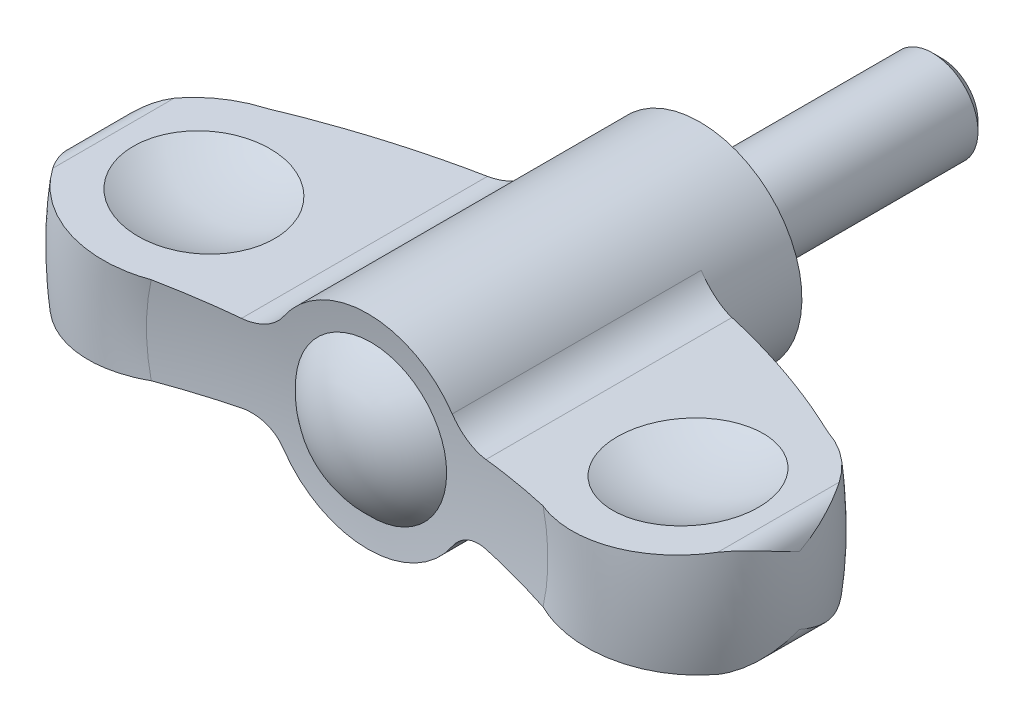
ISO-10303-21;
HEADER;
FILE_DESCRIPTION(('STEP AP214'),'2;1');
FILE_NAME('part.step','',(''),(''),'','','');
FILE_SCHEMA(('AUTOMOTIVE_DESIGN { 1 0 10303 214 1 1 1 1 }'));
ENDSEC;
DATA;
#1=APPLICATION_CONTEXT('core data for automotive mechanical design processes');
#2=APPLICATION_PROTOCOL_DEFINITION('international standard','automotive_design',2000,#1);
#3=PRODUCT_CONTEXT('',#1,'mechanical');
#4=PRODUCT('Part','Part','',(#3));
#5=PRODUCT_RELATED_PRODUCT_CATEGORY('part','',(#4));
#6=PRODUCT_DEFINITION_FORMATION('','',#4);
#7=PRODUCT_DEFINITION_CONTEXT('part definition',#1,'design');
#8=PRODUCT_DEFINITION('design','',#6,#7);
#9=PRODUCT_DEFINITION_SHAPE('','',#8);
#10=(LENGTH_UNIT() NAMED_UNIT(*) SI_UNIT(.MILLI.,.METRE.));
#11=(NAMED_UNIT(*) PLANE_ANGLE_UNIT() SI_UNIT($,.RADIAN.));
#12=(NAMED_UNIT(*) SI_UNIT($,.STERADIAN.) SOLID_ANGLE_UNIT());
#13=UNCERTAINTY_MEASURE_WITH_UNIT(LENGTH_MEASURE(1.E-05),#10,'distance_accuracy_value','');
#14=(GEOMETRIC_REPRESENTATION_CONTEXT(3) GLOBAL_UNCERTAINTY_ASSIGNED_CONTEXT((#13)) GLOBAL_UNIT_ASSIGNED_CONTEXT((#10,
#11,#12)) REPRESENTATION_CONTEXT('',''));
#15=CARTESIAN_POINT('',(0.,0.,0.));
#16=DIRECTION('',(0.,0.,1.));
#17=DIRECTION('',(1.,0.,0.));
#18=AXIS2_PLACEMENT_3D('',#15,#16,#17);
#19=CARTESIAN_POINT('',(0.,0.,60.8916836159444));
#20=DIRECTION('',(0.,0.,1.));
#21=DIRECTION('',(0.,1.,0.));
#22=AXIS2_PLACEMENT_3D('',#19,#20,#21);
#23=DEGENERATE_TOROIDAL_SURFACE('',#22,7.24809636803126,57.1330492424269,.F.);
#24=CARTESIAN_POINT('',(0.,0.,5.5));
#25=DIRECTION('',(0.,0.,1.));
#26=DIRECTION('',(0.,1.,0.));
#27=AXIS2_PLACEMENT_3D('',#24,#25,#26);
#28=CIRCLE('',#27,6.75);
#29=CARTESIAN_POINT('',(5.58468393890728,-3.79128016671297,5.5));
#30=VERTEX_POINT('',#29);
#31=CARTESIAN_POINT('',(5.58468393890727,3.79128016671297,5.5));
#32=VERTEX_POINT('',#31);
#33=EDGE_CURVE('E157',#30,#32,#28,.T.);
#34=ORIENTED_EDGE('',*,*,#33,.T.);
#35=CARTESIAN_POINT('',(5.58454817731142,3.79148016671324,5.5000000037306));
#36=CARTESIAN_POINT('',(5.6270350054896,3.72886637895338,5.49999203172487));
#37=CARTESIAN_POINT('',(5.67207292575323,3.66799067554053,5.50109190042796));
#38=CARTESIAN_POINT('',(5.76687239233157,3.55013742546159,5.50546469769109));
#39=CARTESIAN_POINT('',(5.81663303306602,3.49315913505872,5.5087372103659));
#40=CARTESIAN_POINT('',(5.92037232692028,3.3836500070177,5.51740071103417));
#41=CARTESIAN_POINT('',(5.97433893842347,3.33110730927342,5.5227858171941));
#42=CARTESIAN_POINT('',(6.08617319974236,3.23065312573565,5.53558959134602));
#43=CARTESIAN_POINT('',(6.14404090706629,3.1827417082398,5.54300828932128));
#44=CARTESIAN_POINT('',(6.32281948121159,3.04645743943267,5.56816484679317));
#45=CARTESIAN_POINT('',(6.44903201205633,2.9654018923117,5.58881397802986));
#46=CARTESIAN_POINT('',(6.71175482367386,2.82481579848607,5.63683026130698));
#47=CARTESIAN_POINT('',(6.84827321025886,2.76530241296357,5.66420274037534));
#48=CARTESIAN_POINT('',(7.13180529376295,2.66747892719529,5.72532830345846));
#49=CARTESIAN_POINT('',(7.27900617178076,2.62981214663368,5.75923917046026));
#50=CARTESIAN_POINT('',(7.57631968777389,2.57880440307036,5.83159976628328));
#51=CARTESIAN_POINT('',(7.72642802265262,2.56542990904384,5.87004316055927));
#52=CARTESIAN_POINT('',(7.91146899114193,2.56375196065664,5.91959867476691));
#53=CARTESIAN_POINT('',(7.94691227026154,2.56410633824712,5.92918950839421));
#54=CARTESIAN_POINT('',(8.01766035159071,2.56615563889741,5.94852854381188));
#55=CARTESIAN_POINT('',(8.05296528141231,2.56784856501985,5.958276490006));
#56=CARTESIAN_POINT('',(8.08821506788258,2.57020553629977,5.96810530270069));
#57=B_SPLINE_CURVE_WITH_KNOTS('',3,(#35,#36,#37,#38,#39,#40,#41,#42,#43,#44,#45,#46,#47,#48,#49,
#50,#51,#52,#53,#54,#55,#56),.UNSPECIFIED.,.F.,.F.,(4,2,2,2,2,2,2,2,2,2,4),(0.,
0.226923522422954,0.453803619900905,0.680056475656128,0.906312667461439,1.35828167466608,
1.81060994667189,2.27565813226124,2.74006391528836,2.85020967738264,2.96019142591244),.UNSPECIFIED.);
#58=CARTESIAN_POINT('',(8.08801506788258,2.57019216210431,5.96804953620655));
#59=VERTEX_POINT('',#58);
#60=EDGE_CURVE('E251',#32,#59,#57,.T.);
#61=ORIENTED_EDGE('',*,*,#60,.T.);
#62=CARTESIAN_POINT('',(18.5568278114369,3.2698755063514,10.0639861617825));
#63=CARTESIAN_POINT('',(17.7202118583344,3.21396025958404,9.63606709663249));
#64=CARTESIAN_POINT('',(16.8730027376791,3.15733701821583,9.22898268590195));
#65=CARTESIAN_POINT('',(15.1615683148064,3.04295325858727,8.45851890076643));
#66=CARTESIAN_POINT('',(14.2973907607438,2.98519593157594,8.09503297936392));
#67=CARTESIAN_POINT('',(12.5519653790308,2.86854038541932,7.41164455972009));
#68=CARTESIAN_POINT('',(11.6707170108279,2.80964213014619,7.09174344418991));
#69=CARTESIAN_POINT('',(10.3366076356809,2.72047689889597,6.64515483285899));
#70=CARTESIAN_POINT('',(9.88928279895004,2.6905799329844,6.5016730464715));
#71=CARTESIAN_POINT('',(8.99112522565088,2.63055155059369,6.22618011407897));
#72=CARTESIAN_POINT('',(8.54029244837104,2.6004201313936,6.0941691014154));
#73=CARTESIAN_POINT('',(8.08781506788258,2.57017879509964,5.96799377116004));
#74=B_SPLINE_CURVE_WITH_KNOTS('',3,(#62,#63,#64,#65,#66,#67,#68,#69,#70,#71,#72,#73),
.UNSPECIFIED.,.F.,.F.,(4,2,2,2,2,4),(0.,2.82377208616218,5.64049635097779,8.45730995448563,
9.86934742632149,11.2814013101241),.UNSPECIFIED.);
#75=CARTESIAN_POINT('',(18.5564367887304,3.26984937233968,10.0637861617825));
#76=VERTEX_POINT('',#75);
#77=EDGE_CURVE('E242',#76,#59,#74,.T.);
#78=ORIENTED_EDGE('',*,*,#77,.F.);
#79=CARTESIAN_POINT('',(0.,0.,10.0637861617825));
#80=DIRECTION('',(0.,0.,1.));
#81=DIRECTION('',(0.,1.,0.));
#82=AXIS2_PLACEMENT_3D('',#79,#80,#81);
#83=CIRCLE('',#82,18.8423263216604);
#84=CARTESIAN_POINT('',(18.5564367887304,-3.26984937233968,10.0637861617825));
#85=VERTEX_POINT('',#84);
#86=EDGE_CURVE('E402',#85,#76,#83,.T.);
#87=ORIENTED_EDGE('',*,*,#86,.F.);
#88=CARTESIAN_POINT('',(8.08781506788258,-2.57017879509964,5.96799377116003));
#89=CARTESIAN_POINT('',(8.43648524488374,-2.59348217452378,6.06521586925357));
#90=CARTESIAN_POINT('',(8.78418982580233,-2.6167210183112,6.16591362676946));
#91=CARTESIAN_POINT('',(9.47752423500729,-2.66306003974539,6.37414417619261));
#92=CARTESIAN_POINT('',(9.82315423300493,-2.68616022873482,6.48167640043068));
#93=CARTESIAN_POINT('',(10.8568675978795,-2.7552484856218,6.81439605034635));
#94=CARTESIAN_POINT('',(11.5417095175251,-2.80101991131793,7.04968835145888));
#95=CARTESIAN_POINT('',(13.5766416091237,-2.93702464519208,7.79319141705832));
#96=CARTESIAN_POINT('',(14.9128146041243,-3.02632779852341,8.34061833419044));
#97=CARTESIAN_POINT('',(16.6182429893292,-3.14031014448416,9.11672807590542));
#98=CARTESIAN_POINT('',(17.0086949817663,-3.16640601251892,9.29983650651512));
#99=CARTESIAN_POINT('',(17.785774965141,-3.21834217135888,9.67514693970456));
#100=CARTESIAN_POINT('',(18.1723980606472,-3.24418213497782,9.86735912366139));
#101=CARTESIAN_POINT('',(18.5568278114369,-3.2698755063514,10.0639861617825));
#102=B_SPLINE_CURVE_WITH_KNOTS('',3,(#88,#89,#90,#91,#92,#93,#94,#95,#96,#97,#98,#99,#100,#101),
.UNSPECIFIED.,.F.,.F.,(4,2,2,2,2,2,4),(0.,1.0881425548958,2.17619484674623,4.35250158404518,
8.68743833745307,9.98350841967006,11.2810638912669),.UNSPECIFIED.);
#103=CARTESIAN_POINT('',(8.08801506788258,-2.57019216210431,5.96804953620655));
#104=VERTEX_POINT('',#103);
#105=EDGE_CURVE('E232',#104,#85,#102,.T.);
#106=ORIENTED_EDGE('',*,*,#105,.F.);
#107=CARTESIAN_POINT('',(8.08821506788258,-2.57020553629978,5.96810530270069));
#108=CARTESIAN_POINT('',(8.00997344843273,-2.56497338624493,5.94629000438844));
#109=CARTESIAN_POINT('',(7.9314394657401,-2.5630200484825,5.92486614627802));
#110=CARTESIAN_POINT('',(7.77422277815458,-2.56573749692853,5.88295181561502));
#111=CARTESIAN_POINT('',(7.69554004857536,-2.57040950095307,5.862461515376));
#112=CARTESIAN_POINT('',(7.45993217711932,-2.59446790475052,5.80261995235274));
#113=CARTESIAN_POINT('',(7.30348188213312,-2.62389903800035,5.7649076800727));
#114=CARTESIAN_POINT('',(6.99637317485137,-2.7094115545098,5.69535012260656));
#115=CARTESIAN_POINT('',(6.84572761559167,-2.76554877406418,5.66351732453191));
#116=CARTESIAN_POINT('',(6.55526150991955,-2.90348395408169,5.60733410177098));
#117=CARTESIAN_POINT('',(6.4154250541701,-2.98524327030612,5.58297251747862));
#118=CARTESIAN_POINT('',(6.21564820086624,-3.12665619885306,5.55280138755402));
#119=CARTESIAN_POINT('',(6.14994832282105,-3.17769981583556,5.54373343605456));
#120=CARTESIAN_POINT('',(6.0231628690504,-3.28560819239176,5.52805647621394));
#121=CARTESIAN_POINT('',(5.96207731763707,-3.34247298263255,5.5214474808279));
#122=CARTESIAN_POINT('',(5.84481263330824,-3.46187538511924,5.51078652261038));
#123=CARTESIAN_POINT('',(5.78866161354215,-3.52444182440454,5.50674848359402));
#124=CARTESIAN_POINT('',(5.68213708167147,-3.65444758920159,5.50134928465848));
#125=CARTESIAN_POINT('',(5.63176510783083,-3.72188820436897,5.49998883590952));
#126=CARTESIAN_POINT('',(5.58454817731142,-3.79148016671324,5.50000000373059));
#127=B_SPLINE_CURVE_WITH_KNOTS('',3,(#107,#108,#109,#110,#111,#112,#113,#114,#115,#116,#117,
#118,#119,#120,#121,#122,#123,#124,#125,#126),.UNSPECIFIED.,.F.,.F.,(4,2,2,2,2,2,2,2,2,4),(0.,
0.244043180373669,0.488131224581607,0.976413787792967,1.46572175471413,1.95429525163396,
2.20506346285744,2.4558329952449,2.70794934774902,2.96013265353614),.UNSPECIFIED.);
#128=EDGE_CURVE('E222',#104,#30,#127,.T.);
#129=ORIENTED_EDGE('',*,*,#128,.T.);
#130=EDGE_LOOP('',(#34,#61,#78,#87,#106,#129));
#131=FACE_BOUND('',#130,.T.);
#132=ADVANCED_FACE('F14',(#131),#23,.F.);
#133=CARTESIAN_POINT('',(0.,0.,16.8));
#134=DIRECTION('',(0.,0.,1.));
#135=DIRECTION('',(0.,1.,0.));
#136=AXIS2_PLACEMENT_3D('',#133,#134,#135);
#137=TOROIDAL_SURFACE('',#136,16.3,7.2);
#138=CARTESIAN_POINT('',(-13.4430070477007,-2.92809317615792,10.0635861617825));
#139=CARTESIAN_POINT('',(-13.250045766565,-2.91519660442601,10.1357408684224));
#140=CARTESIAN_POINT('',(-13.0601324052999,-2.90250374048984,10.216071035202));
#141=CARTESIAN_POINT('',(-12.6877100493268,-2.8776128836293,10.3924240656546));
#142=CARTESIAN_POINT('',(-12.5052008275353,-2.86541487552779,10.4884464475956));
#143=CARTESIAN_POINT('',(-12.1489194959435,-2.84160280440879,10.6955091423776));
#144=CARTESIAN_POINT('',(-11.9751456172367,-2.8299886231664,10.8065463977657));
#145=CARTESIAN_POINT('',(-11.6375334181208,-2.8074243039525,11.042874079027));
#146=CARTESIAN_POINT('',(-11.47369496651,-2.79647415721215,11.1681643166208));
#147=CARTESIAN_POINT('',(-11.1570734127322,-2.77531274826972,11.4321870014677));
#148=CARTESIAN_POINT('',(-11.0042945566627,-2.76510176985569,11.5709245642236));
#149=CARTESIAN_POINT('',(-10.7109328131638,-2.74549493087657,11.8608983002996));
#150=CARTESIAN_POINT('',(-10.570354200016,-2.73609935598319,12.0121388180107));
#151=CARTESIAN_POINT('',(-10.3025713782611,-2.7182020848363,12.3259661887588));
#152=CARTESIAN_POINT('',(-10.1753613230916,-2.70969999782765,12.4885480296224));
#153=CARTESIAN_POINT('',(-9.93523518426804,-2.69365116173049,12.8239887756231));
#154=CARTESIAN_POINT('',(-9.82231883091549,-2.68610439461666,12.9968474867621));
#155=CARTESIAN_POINT('',(-9.61240942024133,-2.67207509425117,13.3504168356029));
#156=CARTESIAN_POINT('',(-9.51531257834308,-2.6655856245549,13.5310655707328));
#157=CARTESIAN_POINT('',(-9.33694719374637,-2.6536645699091,13.8999735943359));
#158=CARTESIAN_POINT('',(-9.2556730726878,-2.64823261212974,14.0882301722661));
#159=CARTESIAN_POINT('',(-9.10959731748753,-2.63846963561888,14.4711021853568));
#160=CARTESIAN_POINT('',(-9.0447989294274,-2.63413883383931,14.6657188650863));
#161=CARTESIAN_POINT('',(-8.93227844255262,-2.62661852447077,15.0598492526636));
#162=CARTESIAN_POINT('',(-8.88455601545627,-2.62342899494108,15.2593628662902));
#163=CARTESIAN_POINT('',(-8.80746852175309,-2.61827685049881,15.6574650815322));
#164=CARTESIAN_POINT('',(-8.77773054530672,-2.6162893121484,15.8559812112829));
#165=CARTESIAN_POINT('',(-8.73529826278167,-2.6134533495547,16.2548338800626));
#166=CARTESIAN_POINT('',(-8.7226036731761,-2.61260490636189,16.4551703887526));
#167=CARTESIAN_POINT('',(-8.71437606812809,-2.61205501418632,16.8561671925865));
#168=CARTESIAN_POINT('',(-8.71884052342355,-2.61235339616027,17.0568274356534));
#169=CARTESIAN_POINT('',(-8.74488386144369,-2.61409400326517,17.4570282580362));
#170=CARTESIAN_POINT('',(-8.76646264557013,-2.6155362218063,17.6565688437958));
#171=CARTESIAN_POINT('',(-8.82608238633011,-2.6195209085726,18.0500864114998));
#172=CARTESIAN_POINT('',(-8.86387061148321,-2.62204648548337,18.2441019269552));
#173=CARTESIAN_POINT('',(-8.95554073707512,-2.62817326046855,18.6283441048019));
#174=CARTESIAN_POINT('',(-9.00942811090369,-2.63177482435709,18.8185694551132));
#175=CARTESIAN_POINT('',(-9.13281555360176,-2.64002142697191,19.1937999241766));
#176=CARTESIAN_POINT('',(-9.20231107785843,-2.64466616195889,19.3788065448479));
#177=CARTESIAN_POINT('',(-9.35638258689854,-2.6549635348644,19.742479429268));
#178=CARTESIAN_POINT('',(-9.44096421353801,-2.66061654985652,19.9211432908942));
#179=CARTESIAN_POINT('',(-9.62545322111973,-2.67294687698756,20.2726485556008));
#180=CARTESIAN_POINT('',(-9.72550696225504,-2.6796339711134,20.4454127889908));
#181=CARTESIAN_POINT('',(-9.93957002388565,-2.69394088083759,20.7821124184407));
#182=CARTESIAN_POINT('',(-10.0535844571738,-2.70156103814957,20.9460445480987));
#183=CARTESIAN_POINT('',(-10.2946584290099,-2.71767322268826,21.263898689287));
#184=CARTESIAN_POINT('',(-10.4217143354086,-2.7261650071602,21.4178234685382));
#185=CARTESIAN_POINT('',(-10.688029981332,-2.74396421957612,21.7147703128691));
#186=CARTESIAN_POINT('',(-10.8272940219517,-2.75327193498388,21.8577885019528));
#187=CARTESIAN_POINT('',(-11.1201972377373,-2.77284812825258,22.1349543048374));
#188=CARTESIAN_POINT('',(-11.2740848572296,-2.78313321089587,22.2688382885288));
#189=CARTESIAN_POINT('',(-11.5924511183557,-2.80441122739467,22.5232972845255));
#190=CARTESIAN_POINT('',(-11.7569299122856,-2.81540417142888,22.6438721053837));
#191=CARTESIAN_POINT('',(-12.0953583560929,-2.83802304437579,22.8709220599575));
#192=CARTESIAN_POINT('',(-12.2693100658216,-2.84964911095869,22.9773941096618));
#193=CARTESIAN_POINT('',(-12.6253835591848,-2.87344729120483,23.175449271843));
#194=CARTESIAN_POINT('',(-12.8075027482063,-2.88561923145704,23.2670370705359));
#195=CARTESIAN_POINT('',(-13.1810420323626,-2.9105847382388,23.4357878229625));
#196=CARTESIAN_POINT('',(-13.37255033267,-2.92338419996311,23.5127547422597));
#197=CARTESIAN_POINT('',(-13.7613485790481,-2.94936953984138,23.6502587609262));
#198=CARTESIAN_POINT('',(-13.9586384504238,-2.96255541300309,23.7107960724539));
#199=CARTESIAN_POINT('',(-14.3576152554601,-2.98922103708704,23.8149976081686));
#200=CARTESIAN_POINT('',(-14.5593023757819,-3.00270080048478,23.8586611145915));
#201=CARTESIAN_POINT('',(-14.9656299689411,-3.02985771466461,23.9287762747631));
#202=CARTESIAN_POINT('',(-15.170270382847,-3.04353486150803,23.9552282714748));
#203=CARTESIAN_POINT('',(-15.5810553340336,-3.07098968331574,23.9907056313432));
#204=CARTESIAN_POINT('',(-15.7871999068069,-3.08476736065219,23.9997305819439));
#205=CARTESIAN_POINT('',(-16.1994347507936,-3.11231908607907,24.000257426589));
#206=CARTESIAN_POINT('',(-16.4055250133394,-3.1260931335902,23.9917658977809));
#207=CARTESIAN_POINT('',(-16.816299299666,-3.15354724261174,23.9572980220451));
#208=CARTESIAN_POINT('',(-17.0209829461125,-3.16722727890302,23.9313171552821));
#209=CARTESIAN_POINT('',(-17.4273317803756,-3.19438561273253,23.8620348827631));
#210=CARTESIAN_POINT('',(-17.6289980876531,-3.20786398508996,23.8187400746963));
#211=CARTESIAN_POINT('',(-18.0267250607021,-3.23444607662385,23.7154246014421));
#212=CARTESIAN_POINT('',(-18.2228121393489,-3.24755156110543,23.6555060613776));
#213=CARTESIAN_POINT('',(-18.6091495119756,-3.27337242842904,23.5192613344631));
#214=CARTESIAN_POINT('',(-18.7994018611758,-3.28608794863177,23.4429410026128));
#215=CARTESIAN_POINT('',(-19.1728922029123,-3.31105018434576,23.2743446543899));
#216=CARTESIAN_POINT('',(-19.3561252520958,-3.32329656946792,23.1820576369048));
#217=CARTESIAN_POINT('',(-19.7140940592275,-3.34722142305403,22.9822113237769));
#218=CARTESIAN_POINT('',(-19.8888301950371,-3.35889991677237,22.8746527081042));
#219=CARTESIAN_POINT('',(-20.2275235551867,-3.38153649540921,22.6457025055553));
#220=CARTESIAN_POINT('',(-20.3915386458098,-3.39249844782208,22.5243968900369));
#221=CARTESIAN_POINT('',(-20.7087215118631,-3.41369737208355,22.2682963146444));
#222=CARTESIAN_POINT('',(-20.8618896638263,-3.42393436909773,22.133501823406));
#223=CARTESIAN_POINT('',(-21.1559703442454,-3.44358925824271,21.851664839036));
#224=CARTESIAN_POINT('',(-21.296906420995,-3.45300872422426,21.704646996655));
#225=CARTESIAN_POINT('',(-21.565777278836,-3.47097871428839,21.3992346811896));
#226=CARTESIAN_POINT('',(-21.6937203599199,-3.47952979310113,21.240847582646));
#227=CARTESIAN_POINT('',(-21.8466005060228,-3.48974754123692,21.0342564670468));
#228=CARTESIAN_POINT('',(-21.8780226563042,-3.49184764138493,20.9907857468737));
#229=CARTESIAN_POINT('',(-21.9398602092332,-3.49598055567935,20.9031903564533));
#230=CARTESIAN_POINT('',(-21.9702765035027,-3.49801342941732,20.8590663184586));
#231=CARTESIAN_POINT('',(-22.0002000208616,-3.50001336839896,20.8146028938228));
#232=B_SPLINE_CURVE_WITH_KNOTS('',3,(#138,#139,#140,#141,#142,#143,#144,#145,#146,#147,#148,
#149,#150,#151,#152,#153,#154,#155,#156,#157,#158,#159,#160,#161,#162,#163,#164,#165,#166,#167,
#168,#169,#170,#171,#172,#173,#174,#175,#176,#177,#178,#179,#180,#181,#182,#183,#184,#185,#186,
#187,#188,#189,#190,#191,#192,#193,#194,#195,#196,#197,#198,#199,#200,#201,#202,#203,#204,#205,
#206,#207,#208,#209,#210,#211,#212,#213,#214,#215,#216,#217,#218,#219,#220,#221,#222,#223,#224,
#225,#226,#227,#228,#229,#230,#231),.UNSPECIFIED.,.F.,.F.,(4,2,2,2,2,2,2,2,2,2,2,2,2,2,2,2,2,2,
2,2,2,2,2,2,2,2,2,2,2,2,2,2,2,2,2,2,2,2,2,2,2,2,2,2,2,2,4),(0.,0.619053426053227,
1.23808785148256,1.85699641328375,2.47589680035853,3.09503355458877,3.71438635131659,
4.33346714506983,4.95253625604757,5.56736438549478,6.18197536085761,6.79670733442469,
7.41142748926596,8.01292036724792,8.61440323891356,9.21579745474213,9.81718820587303,
10.4095249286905,11.0020632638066,11.5944292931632,12.1870173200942,12.7855991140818,
13.3844007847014,13.9830361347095,14.5818832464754,15.1938756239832,15.8058768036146,
16.4180115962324,17.029953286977,17.6495959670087,18.2692306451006,18.8888916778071,
19.5085403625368,20.1282037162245,20.7476344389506,21.3672253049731,21.9865802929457,
22.6022115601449,23.217623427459,23.8334610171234,24.4492711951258,25.0614231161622,
25.6735537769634,26.2844785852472,26.8950106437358,27.0560402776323,27.216923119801),.UNSPECIFIED.);
#233=CARTESIAN_POINT('',(-12.9627653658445,-2.89599621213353,23.3370956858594));
#234=VERTEX_POINT('',#233);
#235=CARTESIAN_POINT('',(-22.0000000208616,-3.5,20.8149000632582));
#236=VERTEX_POINT('',#235);
#237=EDGE_CURVE('E276',#234,#236,#232,.T.);
#238=ORIENTED_EDGE('',*,*,#237,.F.);
#239=CARTESIAN_POINT('',(0.,0.,23.3370956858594));
#240=DIRECTION('',(0.,0.,1.));
#241=DIRECTION('',(0.,1.,0.));
#242=AXIS2_PLACEMENT_3D('',#239,#240,#241);
#243=CIRCLE('',#242,13.2823220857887);
#244=CARTESIAN_POINT('',(-12.9627653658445,2.89599621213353,23.3370956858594));
#245=VERTEX_POINT('',#244);
#246=EDGE_CURVE('E210',#245,#234,#243,.T.);
#247=ORIENTED_EDGE('',*,*,#246,.F.);
#248=CARTESIAN_POINT('',(-22.0002,3.50001336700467,20.8146029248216));
#249=CARTESIAN_POINT('',(-21.8869659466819,3.49244536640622,20.9829001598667));
#250=CARTESIAN_POINT('',(-21.7665908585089,3.48440009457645,21.1463645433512));
#251=CARTESIAN_POINT('',(-21.5125154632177,3.46741895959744,21.4625195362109));
#252=CARTESIAN_POINT('',(-21.378816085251,3.45848315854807,21.6152108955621));
#253=CARTESIAN_POINT('',(-21.0991608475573,3.43979239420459,21.9086013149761));
#254=CARTESIAN_POINT('',(-20.9532163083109,3.43003818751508,22.0493112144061));
#255=CARTESIAN_POINT('',(-20.6500231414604,3.4097742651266,22.3179109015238));
#256=CARTESIAN_POINT('',(-20.4927745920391,3.399264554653,22.445800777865));
#257=CARTESIAN_POINT('',(-20.1680719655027,3.377563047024,22.6878898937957));
#258=CARTESIAN_POINT('',(-20.0006161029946,3.36637113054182,22.8020867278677));
#259=CARTESIAN_POINT('',(-19.6566594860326,3.34338278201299,23.0160136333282));
#260=CARTESIAN_POINT('',(-19.4801554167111,3.33158612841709,23.1157383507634));
#261=CARTESIAN_POINT('',(-19.1195107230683,3.3074824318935,23.299940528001));
#262=CARTESIAN_POINT('',(-18.9353740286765,3.29517565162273,23.3844257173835));
#263=CARTESIAN_POINT('',(-18.5606181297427,3.27012883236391,23.5376689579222));
#264=CARTESIAN_POINT('',(-18.369996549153,3.25738863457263,23.6064211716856));
#265=CARTESIAN_POINT('',(-17.9830362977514,3.23152613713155,23.7279050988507));
#266=CARTESIAN_POINT('',(-17.7866806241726,3.21840270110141,23.780582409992));
#267=CARTESIAN_POINT('',(-17.3901835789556,3.19190281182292,23.8692781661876));
#268=CARTESIAN_POINT('',(-17.1900408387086,3.17852626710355,23.9052904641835));
#269=CARTESIAN_POINT('',(-16.7874574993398,3.15161960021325,23.9604036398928));
#270=CARTESIAN_POINT('',(-16.5850169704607,3.13808948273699,23.9795050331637));
#271=CARTESIAN_POINT('',(-16.1792478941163,3.11096989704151,24.0006952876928));
#272=CARTESIAN_POINT('',(-15.9759193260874,3.09738042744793,24.0027837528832));
#273=CARTESIAN_POINT('',(-15.5684666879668,3.07014832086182,23.9899203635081));
#274=CARTESIAN_POINT('',(-15.364346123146,3.05650591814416,23.9748568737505));
#275=CARTESIAN_POINT('',(-14.9580777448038,3.02935296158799,23.9276425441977));
#276=CARTESIAN_POINT('',(-14.755929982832,3.01584241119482,23.8954912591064));
#277=CARTESIAN_POINT('',(-14.3550670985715,2.98905073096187,23.814360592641));
#278=CARTESIAN_POINT('',(-14.1563513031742,2.97576955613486,23.7653845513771));
#279=CARTESIAN_POINT('',(-13.7636331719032,2.94952223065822,23.6509482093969));
#280=CARTESIAN_POINT('',(-13.5696323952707,2.9365561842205,23.5854825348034));
#281=CARTESIAN_POINT('',(-13.1865164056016,2.91095061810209,23.4380671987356));
#282=CARTESIAN_POINT('',(-12.9974412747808,2.89831377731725,23.356012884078));
#283=CARTESIAN_POINT('',(-12.6268363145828,2.87354438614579,23.1762764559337));
#284=CARTESIAN_POINT('',(-12.4453065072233,2.86141183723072,23.078594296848));
#285=CARTESIAN_POINT('',(-12.0910342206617,2.83773404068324,22.8682633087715));
#286=CARTESIAN_POINT('',(-11.9182938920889,2.8261889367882,22.7556108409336));
#287=CARTESIAN_POINT('',(-11.5829402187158,2.80377556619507,22.516182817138));
#288=CARTESIAN_POINT('',(-11.4203233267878,2.79290706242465,22.3894122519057));
#289=CARTESIAN_POINT('',(-11.1059013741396,2.77189266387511,22.1222291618));
#290=CARTESIAN_POINT('',(-10.9541266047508,2.76174879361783,21.9817808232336));
#291=CARTESIAN_POINT('',(-10.6630509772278,2.74229474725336,21.6885550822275));
#292=CARTESIAN_POINT('',(-10.5237454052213,2.73298425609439,21.5357823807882));
#293=CARTESIAN_POINT('',(-10.2585504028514,2.71525994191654,21.2188580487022));
#294=CARTESIAN_POINT('',(-10.1326659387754,2.7068464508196,21.0547022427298));
#295=CARTESIAN_POINT('',(-9.89540453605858,2.69098907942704,20.7162706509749));
#296=CARTESIAN_POINT('',(-9.78402188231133,2.68354481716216,20.5419988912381));
#297=CARTESIAN_POINT('',(-9.57753567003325,2.66974430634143,20.1860989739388));
#298=CARTESIAN_POINT('',(-9.48229586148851,2.66337895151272,20.0045502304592));
#299=CARTESIAN_POINT('',(-9.30772151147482,2.65171127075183,19.6340070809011));
#300=CARTESIAN_POINT('',(-9.22838099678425,2.64640854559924,19.445015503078));
#301=CARTESIAN_POINT('',(-9.0862443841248,2.6369088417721,19.0608700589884));
#302=CARTESIAN_POINT('',(-9.02344908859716,2.63271191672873,18.8657158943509));
#303=CARTESIAN_POINT('',(-8.91497467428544,2.62546202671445,18.4706862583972));
#304=CARTESIAN_POINT('',(-8.86929523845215,2.62240904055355,18.2708108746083));
#305=CARTESIAN_POINT('',(-8.79627719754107,2.61752887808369,17.8722020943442));
#306=CARTESIAN_POINT('',(-8.76856256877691,2.61567657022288,17.6735378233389));
#307=CARTESIAN_POINT('',(-8.73017446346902,2.61311090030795,17.2745631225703));
#308=CARTESIAN_POINT('',(-8.71950071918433,2.61239752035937,17.0742527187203));
#309=CARTESIAN_POINT('',(-8.71529310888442,2.61211630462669,16.6734663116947));
#310=CARTESIAN_POINT('',(-8.72175798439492,2.61254838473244,16.4729903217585));
#311=CARTESIAN_POINT('',(-8.75176494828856,2.61455390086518,16.0733272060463));
#312=CARTESIAN_POINT('',(-8.77530694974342,2.61612733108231,15.8741400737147));
#313=CARTESIAN_POINT('',(-8.83878915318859,2.62037016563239,15.481363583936));
#314=CARTESIAN_POINT('',(-8.87848770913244,2.62302341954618,15.2877349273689));
#315=CARTESIAN_POINT('',(-8.97393104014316,2.62940237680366,14.9044232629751));
#316=CARTESIAN_POINT('',(-9.029681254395,2.6331284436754,14.7147416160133));
#317=CARTESIAN_POINT('',(-9.15673580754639,2.64162013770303,14.3407362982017));
#318=CARTESIAN_POINT('',(-9.2280365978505,2.64638552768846,14.1564114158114));
#319=CARTESIAN_POINT('',(-9.38562068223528,2.65691766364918,13.7943056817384));
#320=CARTESIAN_POINT('',(-9.47190458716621,2.66268445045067,13.6165250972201));
#321=CARTESIAN_POINT('',(-9.65980249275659,2.67524261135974,13.2667770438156));
#322=CARTESIAN_POINT('',(-9.76157423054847,2.68204452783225,13.094894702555));
#323=CARTESIAN_POINT('',(-9.97895442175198,2.69657313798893,12.7601587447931));
#324=CARTESIAN_POINT('',(-10.094562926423,2.70429983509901,12.5973051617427));
#325=CARTESIAN_POINT('',(-10.3388280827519,2.72062530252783,12.28159984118));
#326=CARTESIAN_POINT('',(-10.4674919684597,2.72922455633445,12.1287537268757));
#327=CARTESIAN_POINT('',(-10.7368892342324,2.74722972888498,11.8341521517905));
#328=CARTESIAN_POINT('',(-10.8776225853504,2.75663564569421,11.6923966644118));
#329=CARTESIAN_POINT('',(-11.1735584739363,2.77641452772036,11.4177499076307));
#330=CARTESIAN_POINT('',(-11.3290201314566,2.78680481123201,11.2851390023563));
#331=CARTESIAN_POINT('',(-11.6503816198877,2.80828301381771,11.0334204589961));
#332=CARTESIAN_POINT('',(-11.8162777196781,2.81937068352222,10.914308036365));
#333=CARTESIAN_POINT('',(-12.1571151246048,2.8421505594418,10.690516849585));
#334=CARTESIAN_POINT('',(-12.3320419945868,2.85384180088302,10.5858159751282));
#335=CARTESIAN_POINT('',(-12.6898958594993,2.87775897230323,10.3913862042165));
#336=CARTESIAN_POINT('',(-12.8728180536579,2.88998458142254,10.3016484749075));
#337=CARTESIAN_POINT('',(-13.1223586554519,2.90666263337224,10.1918600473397));
#338=CARTESIAN_POINT('',(-13.1860214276,2.9109175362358,10.1649193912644));
#339=CARTESIAN_POINT('',(-13.3140099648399,2.91947165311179,10.1128788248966));
#340=CARTESIAN_POINT('',(-13.3783349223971,2.92377081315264,10.0877769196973));
#341=CARTESIAN_POINT('',(-13.4430070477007,2.92809317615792,10.0635861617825));
#342=B_SPLINE_CURVE_WITH_KNOTS('',3,(#248,#249,#250,#251,#252,#253,#254,#255,#256,#257,#258,
#259,#260,#261,#262,#263,#264,#265,#266,#267,#268,#269,#270,#271,#272,#273,#274,#275,#276,#277,
#278,#279,#280,#281,#282,#283,#284,#285,#286,#287,#288,#289,#290,#291,#292,#293,#294,#295,#296,
#297,#298,#299,#300,#301,#302,#303,#304,#305,#306,#307,#308,#309,#310,#311,#312,#313,#314,#315,
#316,#317,#318,#319,#320,#321,#322,#323,#324,#325,#326,#327,#328,#329,#330,#331,#332,#333,#334,
#335,#336,#337,#338,#339,#340,#341),.UNSPECIFIED.,.F.,.F.,(4,2,2,2,2,2,2,2,2,2,2,2,2,2,2,2,2,2,
2,2,2,2,2,2,2,2,2,2,2,2,2,2,2,2,2,2,2,2,2,2,2,2,2,2,2,2,4),(0.,0.608767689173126,
1.21749295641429,1.82566153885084,2.43382591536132,3.04209697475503,3.65059249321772,
4.25877850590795,4.86718980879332,5.47763788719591,6.08831095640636,6.698965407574,
7.30963407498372,7.92430017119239,8.53898228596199,9.15354244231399,9.76830314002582,
10.387070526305,11.0058397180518,11.6247595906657,12.2434613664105,12.8638290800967,
13.4839612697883,14.1043221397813,14.7244377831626,15.3390262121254,15.9533833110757,
16.5677702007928,17.1821457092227,17.7832066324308,18.3842581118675,18.9852654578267,
19.5862697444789,20.1785973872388,20.7711259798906,21.3635195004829,21.9559371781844,
22.5548514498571,23.1537679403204,23.7530181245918,24.3522668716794,24.9653566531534,
25.5782284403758,26.1901492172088,26.8017074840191,27.0094652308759,27.2169941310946),.UNSPECIFIED.);
#343=CARTESIAN_POINT('',(-22.,3.5,20.8149000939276));
#344=VERTEX_POINT('',#343);
#345=EDGE_CURVE('E298',#344,#245,#342,.T.);
#346=ORIENTED_EDGE('',*,*,#345,.F.);
#347=CARTESIAN_POINT('',(-23.3936651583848,2.23303167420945,16.8));
#348=CARTESIAN_POINT('',(-23.3934426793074,2.23536251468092,16.8051493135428));
#349=CARTESIAN_POINT('',(-23.3932143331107,2.23769289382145,16.8102988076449));
#350=CARTESIAN_POINT('',(-23.3743145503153,2.42570445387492,17.2258528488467));
#351=CARTESIAN_POINT('',(-23.3183956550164,2.60830531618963,17.6373544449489));
#352=CARTESIAN_POINT('',(-23.1798743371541,2.85965877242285,18.2505518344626));
#353=CARTESIAN_POINT('',(-23.1245479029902,2.939723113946,18.4543861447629));
#354=CARTESIAN_POINT('',(-22.9956909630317,3.08909813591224,18.8603432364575));
#355=CARTESIAN_POINT('',(-22.9221687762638,3.1584137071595,19.0624667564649));
#356=CARTESIAN_POINT('',(-22.7850793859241,3.26116367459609,19.3959296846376));
#357=CARTESIAN_POINT('',(-22.7265638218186,3.29880232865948,19.5280746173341));
#358=CARTESIAN_POINT('',(-22.6018254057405,3.36602668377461,19.7906656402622));
#359=CARTESIAN_POINT('',(-22.5356088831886,3.39561893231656,19.9211130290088));
#360=CARTESIAN_POINT('',(-22.395316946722,3.44509635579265,20.180513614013));
#361=CARTESIAN_POINT('',(-22.3212053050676,3.46493421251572,20.3094566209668));
#362=CARTESIAN_POINT('',(-22.2046559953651,3.48552373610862,20.500765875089));
#363=CARTESIAN_POINT('',(-22.1648550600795,3.49085996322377,20.5642643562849));
#364=CARTESIAN_POINT('',(-22.0835651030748,3.49809816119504,20.6904076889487));
#365=CARTESIAN_POINT('',(-22.0420753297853,3.49999858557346,20.7530521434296));
#366=CARTESIAN_POINT('',(-21.9998,3.49999998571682,20.8151941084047));
#367=B_SPLINE_CURVE_WITH_KNOTS('',3,(#347,#348,#349,#350,#351,#352,#353,#354,#355,#356,#357,
#358,#359,#360,#361,#362,#363,#364,#365,#366),.UNSPECIFIED.,.F.,.F.,(4,2,2,2,2,2,2,2,2,4),(0.,
0.016970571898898,1.36944581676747,2.04642868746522,2.72310261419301,3.17077232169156,
3.61807665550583,4.06752995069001,4.29283181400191,4.51823506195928),.UNSPECIFIED.);
#368=CARTESIAN_POINT('',(-23.3936651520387,2.23303174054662,16.8));
#369=VERTEX_POINT('',#368);
#370=EDGE_CURVE('E360',#369,#344,#367,.T.);
#371=ORIENTED_EDGE('',*,*,#370,.F.);
#372=CARTESIAN_POINT('',(-21.9998,3.49999998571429,12.7848058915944));
#373=CARTESIAN_POINT('',(-22.0666741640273,3.49996244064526,12.8830879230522));
#374=CARTESIAN_POINT('',(-22.1315514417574,3.4952325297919,12.9826100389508));
#375=CARTESIAN_POINT('',(-22.2568815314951,3.47769367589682,13.1835115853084));
#376=CARTESIAN_POINT('',(-22.3173409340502,3.46489705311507,13.2848879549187));
#377=CARTESIAN_POINT('',(-22.4333648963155,3.43259083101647,13.4887461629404));
#378=CARTESIAN_POINT('',(-22.4889490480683,3.41310980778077,13.5912215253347));
#379=CARTESIAN_POINT('',(-22.5953729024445,3.3684102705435,13.7974289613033));
#380=CARTESIAN_POINT('',(-22.6462099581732,3.34318858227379,13.9011616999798));
#381=CARTESIAN_POINT('',(-22.774089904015,3.2701146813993,14.1765334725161));
#382=CARTESIAN_POINT('',(-22.8470051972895,3.21812877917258,14.3490158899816));
#383=CARTESIAN_POINT('',(-22.9794561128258,3.10414337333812,14.695745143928));
#384=CARTESIAN_POINT('',(-23.0389856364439,3.04213932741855,14.8699927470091));
#385=CARTESIAN_POINT('',(-23.1975205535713,2.84462859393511,15.3951794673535));
#386=CARTESIAN_POINT('',(-23.2763283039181,2.6977147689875,15.7482515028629));
#387=CARTESIAN_POINT('',(-23.3443046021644,2.49442989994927,16.2153989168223));
#388=CARTESIAN_POINT('',(-23.3580236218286,2.44419371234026,16.3292368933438));
#389=CARTESIAN_POINT('',(-23.3797700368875,2.34273549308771,16.5569077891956));
#390=CARTESIAN_POINT('',(-23.3878040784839,2.29151468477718,16.6707405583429));
#391=CARTESIAN_POINT('',(-23.3932143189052,2.23769296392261,16.7897010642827));
#392=CARTESIAN_POINT('',(-23.3934426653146,2.23536258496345,16.7948505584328));
#393=CARTESIAN_POINT('',(-23.3936651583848,2.23303167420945,16.8));
#394=B_SPLINE_CURVE_WITH_KNOTS('',3,(#372,#373,#374,#375,#376,#377,#378,#379,#380,#381,#382,
#383,#384,#385,#386,#387,#388,#389,#390,#391,#392,#393),.UNSPECIFIED.,.F.,.F.,(4,2,2,2,2,2,2,2,
2,2,4),(0.,0.356372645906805,0.712202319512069,1.06652937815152,1.42105283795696,
2.00316709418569,2.58554603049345,3.75135617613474,4.12686584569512,4.5019357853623,
4.51890635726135),.UNSPECIFIED.);
#395=CARTESIAN_POINT('',(-22.,3.5,12.7850999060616));
#396=VERTEX_POINT('',#395);
#397=EDGE_CURVE('E354',#396,#369,#394,.T.);
#398=ORIENTED_EDGE('',*,*,#397,.F.);
#399=CARTESIAN_POINT('',(-18.5559048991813,3.26981382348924,10.0635861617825));
#400=CARTESIAN_POINT('',(-18.7481532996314,3.28266274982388,10.1358408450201));
#401=CARTESIAN_POINT('',(-18.9373210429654,3.29530578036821,10.2163336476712));
#402=CARTESIAN_POINT('',(-19.308161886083,3.32009093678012,10.3931469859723));
#403=CARTESIAN_POINT('',(-19.4898343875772,3.332233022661,10.4894687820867));
#404=CARTESIAN_POINT('',(-19.8398224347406,3.35562448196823,10.6946430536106));
#405=CARTESIAN_POINT('',(-20.0083599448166,3.36688869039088,10.8031155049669));
#406=CARTESIAN_POINT('',(-20.3358278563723,3.38877501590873,11.0337190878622));
#407=CARTESIAN_POINT('',(-20.4947599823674,3.39939724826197,11.1558477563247));
#408=CARTESIAN_POINT('',(-20.7764213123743,3.41822208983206,11.3915935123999));
#409=CARTESIAN_POINT('',(-20.9007819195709,3.42653373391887,11.5032605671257));
#410=CARTESIAN_POINT('',(-21.141456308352,3.44261921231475,11.7349898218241));
#411=CARTESIAN_POINT('',(-21.2577703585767,3.45039306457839,11.8550517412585));
#412=CARTESIAN_POINT('',(-21.4842055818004,3.46552686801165,12.105686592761));
#413=CARTESIAN_POINT('',(-21.5941379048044,3.47287419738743,12.2364309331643));
#414=CARTESIAN_POINT('',(-21.8044661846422,3.48693149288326,12.5054420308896));
#415=CARTESIAN_POINT('',(-21.9048606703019,3.49364136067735,12.6437099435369));
#416=CARTESIAN_POINT('',(-22.0002,3.50001336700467,12.7853970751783));
#417=B_SPLINE_CURVE_WITH_KNOTS('',3,(#399,#400,#401,#402,#403,#404,#405,#406,#407,#408,#409,
#410,#411,#412,#413,#414,#415,#416),.UNSPECIFIED.,.F.,.F.,(4,2,2,2,2,2,2,2,4),(0.,
0.617158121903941,1.23436541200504,1.83590974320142,2.43734575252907,2.93898887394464,
3.44061523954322,3.95311321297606,4.46569010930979),.UNSPECIFIED.);
#418=CARTESIAN_POINT('',(-18.5564367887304,3.26984937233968,10.0637861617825));
#419=VERTEX_POINT('',#418);
#420=EDGE_CURVE('E277',#419,#396,#417,.T.);
#421=ORIENTED_EDGE('',*,*,#420,.F.);
#422=CARTESIAN_POINT('',(-18.5564367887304,-3.26984937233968,10.0637861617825));
#423=VERTEX_POINT('',#422);
#424=EDGE_CURVE('E399',#419,#423,#83,.T.);
#425=ORIENTED_EDGE('',*,*,#424,.T.);
#426=CARTESIAN_POINT('',(-22.0002000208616,-3.50001336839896,12.7853971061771));
#427=CARTESIAN_POINT('',(-21.8855721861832,-3.49235221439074,12.6150255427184));
#428=CARTESIAN_POINT('',(-21.7636225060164,-3.48420170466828,12.4496052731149));
#429=CARTESIAN_POINT('',(-21.5060663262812,-3.46698793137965,12.1298039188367));
#430=CARTESIAN_POINT('',(-21.3704594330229,-3.45792464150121,11.9754231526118));
#431=CARTESIAN_POINT('',(-21.0901761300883,-3.43919190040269,11.6826018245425));
#432=CARTESIAN_POINT('',(-20.9458162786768,-3.42954360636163,11.5438566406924));
#433=CARTESIAN_POINT('',(-20.6460984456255,-3.4095119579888,11.2788991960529));
#434=CARTESIAN_POINT('',(-20.4907422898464,-3.39912872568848,11.1526848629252));
#435=CARTESIAN_POINT('',(-20.1963110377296,-3.3794504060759,10.9331636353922));
#436=CARTESIAN_POINT('',(-20.058720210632,-3.37025451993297,10.8378487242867));
#437=CARTESIAN_POINT('',(-19.7772660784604,-3.35144352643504,10.6570247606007));
#438=CARTESIAN_POINT('',(-19.6334029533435,-3.34182843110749,10.571515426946));
#439=CARTESIAN_POINT('',(-19.3369202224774,-3.32201300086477,10.4089623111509));
#440=CARTESIAN_POINT('',(-19.1841783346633,-3.31180449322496,10.3321425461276));
#441=CARTESIAN_POINT('',(-18.8736362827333,-3.29104940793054,10.1895126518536));
#442=CARTESIAN_POINT('',(-18.7158354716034,-3.28050278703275,10.123703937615));
#443=CARTESIAN_POINT('',(-18.5559048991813,-3.26981382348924,10.0635861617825));
#444=B_SPLINE_CURVE_WITH_KNOTS('',3,(#426,#427,#428,#429,#430,#431,#432,#433,#434,#435,#436,
#437,#438,#439,#440,#441,#442,#443),.UNSPECIFIED.,.F.,.F.,(4,2,2,2,2,2,2,2,4),(0.,
0.616269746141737,1.23255726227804,1.83324114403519,2.43382551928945,2.93633271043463,
3.43882549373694,3.95222439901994,4.46568922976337),.UNSPECIFIED.);
#445=CARTESIAN_POINT('',(-22.0000000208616,-3.5,12.7850999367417));
#446=VERTEX_POINT('',#445);
#447=EDGE_CURVE('E530',#446,#423,#444,.T.);
#448=ORIENTED_EDGE('',*,*,#447,.F.);
#449=CARTESIAN_POINT('',(-23.3936651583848,-2.23303167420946,16.8));
#450=CARTESIAN_POINT('',(-23.3934426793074,-2.23536251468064,16.794850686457));
#451=CARTESIAN_POINT('',(-23.3932143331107,-2.23769289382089,16.7897011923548));
#452=CARTESIAN_POINT('',(-23.3743145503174,-2.42570445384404,16.374147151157));
#453=CARTESIAN_POINT('',(-23.3183956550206,-2.60830531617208,15.9626455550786));
#454=CARTESIAN_POINT('',(-23.1798743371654,-2.85965877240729,15.349448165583));
#455=CARTESIAN_POINT('',(-23.1245479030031,-2.93972311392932,15.1456138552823));
#456=CARTESIAN_POINT('',(-22.9956909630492,-3.0890981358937,14.739656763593));
#457=CARTESIAN_POINT('',(-22.922168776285,-3.15841370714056,14.5375332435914));
#458=CARTESIAN_POINT('',(-22.7850793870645,-3.26116367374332,14.2040703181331));
#459=CARTESIAN_POINT('',(-22.7265638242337,-3.29880232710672,14.0719253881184));
#460=CARTESIAN_POINT('',(-22.6018254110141,-3.36602668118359,13.8093343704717));
#461=CARTESIAN_POINT('',(-22.5356088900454,-3.39561892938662,13.6788869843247));
#462=CARTESIAN_POINT('',(-22.3953169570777,-3.44509635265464,13.4194864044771));
#463=CARTESIAN_POINT('',(-22.3212053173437,-3.46493420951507,13.2905434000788));
#464=CARTESIAN_POINT('',(-22.2046560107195,-3.48552373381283,13.0992341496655));
#465=CARTESIAN_POINT('',(-22.1648550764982,-3.49085996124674,13.035735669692));
#466=CARTESIAN_POINT('',(-22.083565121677,-3.49809816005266,12.9095923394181));
#467=CARTESIAN_POINT('',(-22.0420753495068,-3.49999858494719,12.8469478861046));
#468=CARTESIAN_POINT('',(-21.9998000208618,-3.4999999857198,12.784805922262));
#469=B_SPLINE_CURVE_WITH_KNOTS('',3,(#449,#450,#451,#452,#453,#454,#455,#456,#457,#458,#459,
#460,#461,#462,#463,#464,#465,#466,#467,#468),.UNSPECIFIED.,.F.,.F.,(4,2,2,2,2,2,2,2,2,4),(0.,
0.0169705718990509,1.36944581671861,2.0464286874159,2.72310261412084,3.17077231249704,
3.61807663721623,4.06752992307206,4.29283178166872,4.51823502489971),.UNSPECIFIED.);
#470=CARTESIAN_POINT('',(-23.393665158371,-2.23303167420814,16.8));
#471=VERTEX_POINT('',#470);
#472=EDGE_CURVE('E372',#471,#446,#469,.T.);
#473=ORIENTED_EDGE('',*,*,#472,.F.);
#474=CARTESIAN_POINT('',(-21.9998000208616,-3.49999998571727,20.8151940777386));
#475=CARTESIAN_POINT('',(-22.0666741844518,-3.49996243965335,20.7169120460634));
#476=CARTESIAN_POINT('',(-22.1315514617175,-3.49523252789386,20.617389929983));
#477=CARTESIAN_POINT('',(-22.2568815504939,-3.47769367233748,20.4164883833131));
#478=CARTESIAN_POINT('',(-22.3173409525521,-3.46489704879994,20.315112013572));
#479=CARTESIAN_POINT('',(-22.4333649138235,-3.43259082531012,20.111253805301));
#480=CARTESIAN_POINT('',(-22.488949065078,-3.41310980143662,20.0087784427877));
#481=CARTESIAN_POINT('',(-22.5953729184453,-3.36841026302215,19.802571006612));
#482=CARTESIAN_POINT('',(-22.6462099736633,-3.34318857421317,19.6988382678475));
#483=CARTESIAN_POINT('',(-22.7740899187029,-3.27011467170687,19.4234664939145));
#484=CARTESIAN_POINT('',(-22.8470052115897,-3.21812876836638,19.2509840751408));
#485=CARTESIAN_POINT('',(-22.9794561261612,-3.10414336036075,18.9042548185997));
#486=CARTESIAN_POINT('',(-23.0389856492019,-3.04213931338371,18.7300072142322));
#487=CARTESIAN_POINT('',(-23.1975205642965,-2.84462857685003,18.2048204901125));
#488=CARTESIAN_POINT('',(-23.2763283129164,-2.69771475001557,17.8517484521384));
#489=CARTESIAN_POINT('',(-23.3443046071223,-2.49442988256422,17.3846010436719));
#490=CARTESIAN_POINT('',(-23.3580236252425,-2.44419369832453,17.2707630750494));
#491=CARTESIAN_POINT('',(-23.379770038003,-2.34273548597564,17.0430921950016));
#492=CARTESIAN_POINT('',(-23.3878040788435,-2.29151468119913,16.9292594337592));
#493=CARTESIAN_POINT('',(-23.3932143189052,-2.23769296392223,16.8102989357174));
#494=CARTESIAN_POINT('',(-23.3934426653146,-2.23536258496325,16.8051494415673));
#495=CARTESIAN_POINT('',(-23.3936651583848,-2.23303167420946,16.8));
#496=B_SPLINE_CURVE_WITH_KNOTS('',3,(#474,#475,#476,#477,#478,#479,#480,#481,#482,#483,#484,
#485,#486,#487,#488,#489,#490,#491,#492,#493,#494,#495),.UNSPECIFIED.,.F.,.F.,(4,2,2,2,2,2,2,2,
2,2,4),(0.,0.356372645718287,0.712202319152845,1.0665293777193,1.42105283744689,
2.00316709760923,2.58554603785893,3.75135619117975,4.12686583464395,4.50193574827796,
4.51890632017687),.UNSPECIFIED.);
#497=EDGE_CURVE('E366',#236,#471,#496,.T.);
#498=ORIENTED_EDGE('',*,*,#497,.F.);
#499=EDGE_LOOP('',(#238,#247,#346,#371,#398,#421,#425,#448,#473,#498));
#500=FACE_BOUND('',#499,.T.);
#501=ADVANCED_FACE('F391',(#500),#137,.T.);
#502=CARTESIAN_POINT('',(0.,0.,0.));
#503=DIRECTION('',(0.,0.,1.));
#504=DIRECTION('',(0.,1.,0.));
#505=AXIS2_PLACEMENT_3D('',#502,#503,#504);
#506=PLANE('',#505);
#507=CARTESIAN_POINT('',(0.,0.,0.));
#508=DIRECTION('',(0.,0.,1.));
#509=DIRECTION('',(0.,1.,0.));
#510=AXIS2_PLACEMENT_3D('',#507,#508,#509);
#511=CIRCLE('',#510,3.);
#512=CARTESIAN_POINT('',(0.,3.,0.));
#513=VERTEX_POINT('',#512);
#514=EDGE_CURVE('E552',#513,#513,#511,.F.);
#515=ORIENTED_EDGE('',*,*,#514,.F.);
#516=EDGE_LOOP('',(#515));
#517=FACE_BOUND('',#516,.T.);
#518=CARTESIAN_POINT('',(0.,0.,0.));
#519=DIRECTION('',(0.,0.,1.));
#520=DIRECTION('',(0.,1.,0.));
#521=AXIS2_PLACEMENT_3D('',#518,#519,#520);
#522=CIRCLE('',#521,6.75);
#523=CARTESIAN_POINT('',(0.,6.75,0.));
#524=VERTEX_POINT('',#523);
#525=EDGE_CURVE('E146',#524,#524,#522,.T.);
#526=ORIENTED_EDGE('',*,*,#525,.F.);
#527=EDGE_LOOP('',(#526));
#528=FACE_BOUND('',#527,.T.);
#529=ADVANCED_FACE('F395',(#517,#528),#506,.F.);
#530=CARTESIAN_POINT('',(0.,0.,21.5));
#531=DIRECTION('',(0.,0.,1.));
#532=DIRECTION('',(0.,1.,0.));
#533=AXIS2_PLACEMENT_3D('',#530,#531,#532);
#534=CYLINDRICAL_SURFACE('',#533,6.75);
#535=CARTESIAN_POINT('',(-5.58468393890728,3.79128016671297,5.5));
#536=VERTEX_POINT('',#535);
#537=CARTESIAN_POINT('',(-5.58468393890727,-3.79128016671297,5.5));
#538=VERTEX_POINT('',#537);
#539=EDGE_CURVE('E398',#536,#538,#28,.T.);
#540=ORIENTED_EDGE('',*,*,#539,.F.);
#541=DIRECTION('',(0.,0.,-1.));
#542=VECTOR('',#541,1.);
#543=CARTESIAN_POINT('',(-5.58468393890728,3.79128016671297,47.));
#544=LINE('',#543,#542);
#545=CARTESIAN_POINT('',(-5.58468393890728,3.79128016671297,21.9677808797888));
#546=VERTEX_POINT('',#545);
#547=EDGE_CURVE('E447',#546,#536,#544,.T.);
#548=ORIENTED_EDGE('',*,*,#547,.F.);
#549=CARTESIAN_POINT('',(0.,0.,21.9677808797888));
#550=DIRECTION('',(0.,0.,1.));
#551=DIRECTION('',(0.,1.,0.));
#552=AXIS2_PLACEMENT_3D('',#549,#550,#551);
#553=CIRCLE('',#552,6.75);
#554=CARTESIAN_POINT('',(5.58468393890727,3.79128016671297,21.9677808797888));
#555=VERTEX_POINT('',#554);
#556=EDGE_CURVE('E516',#555,#546,#553,.T.);
#557=ORIENTED_EDGE('',*,*,#556,.F.);
#558=DIRECTION('',(0.,0.,-1.));
#559=VECTOR('',#558,1.);
#560=CARTESIAN_POINT('',(5.58468393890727,3.79128016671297,47.));
#561=LINE('',#560,#559);
#562=EDGE_CURVE('E445',#555,#32,#561,.T.);
#563=ORIENTED_EDGE('',*,*,#562,.T.);
#564=ORIENTED_EDGE('',*,*,#33,.F.);
#565=DIRECTION('',(0.,0.,-1.));
#566=VECTOR('',#565,1.);
#567=CARTESIAN_POINT('',(5.58468393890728,-3.79128016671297,47.));
#568=LINE('',#567,#566);
#569=CARTESIAN_POINT('',(5.58468393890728,-3.79128016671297,21.9677808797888));
#570=VERTEX_POINT('',#569);
#571=EDGE_CURVE('E140',#570,#30,#568,.T.);
#572=ORIENTED_EDGE('',*,*,#571,.F.);
#573=CARTESIAN_POINT('',(0.,0.,21.9677808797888));
#574=DIRECTION('',(0.,0.,1.));
#575=DIRECTION('',(0.,1.,0.));
#576=AXIS2_PLACEMENT_3D('',#573,#574,#575);
#577=CIRCLE('',#576,6.75);
#578=CARTESIAN_POINT('',(-5.58468393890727,-3.79128016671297,21.9677808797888));
#579=VERTEX_POINT('',#578);
#580=EDGE_CURVE('E153',#579,#570,#577,.T.);
#581=ORIENTED_EDGE('',*,*,#580,.F.);
#582=DIRECTION('',(0.,0.,-1.));
#583=VECTOR('',#582,1.);
#584=CARTESIAN_POINT('',(-5.58468393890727,-3.79128016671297,47.));
#585=LINE('',#584,#583);
#586=EDGE_CURVE('E433',#579,#538,#585,.T.);
#587=ORIENTED_EDGE('',*,*,#586,.T.);
#588=EDGE_LOOP('',(#540,#548,#557,#563,#564,#572,#581,#587));
#589=FACE_BOUND('',#588,.T.);
#590=ORIENTED_EDGE('',*,*,#525,.T.);
#591=EDGE_LOOP('',(#590));
#592=FACE_BOUND('',#591,.T.);
#593=ADVANCED_FACE('F150',(#589,#592),#534,.T.);
#594=CARTESIAN_POINT('',(-8.08781506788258,2.57017879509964,5.96799377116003));
#595=CARTESIAN_POINT('',(-8.43648524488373,2.59348217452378,6.06521586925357));
#596=CARTESIAN_POINT('',(-8.78418982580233,2.6167210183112,6.16591362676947));
#597=CARTESIAN_POINT('',(-9.47752423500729,2.66306003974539,6.37414417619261));
#598=CARTESIAN_POINT('',(-9.82315423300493,2.68616022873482,6.48167640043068));
#599=CARTESIAN_POINT('',(-10.8568675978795,2.7552484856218,6.81439605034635));
#600=CARTESIAN_POINT('',(-11.5417095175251,2.80101991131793,7.04968835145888));
#601=CARTESIAN_POINT('',(-13.5766416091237,2.93702464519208,7.79319141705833));
#602=CARTESIAN_POINT('',(-14.9128146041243,3.02632779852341,8.34061833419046));
#603=CARTESIAN_POINT('',(-16.6182429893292,3.14031014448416,9.11672807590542));
#604=CARTESIAN_POINT('',(-17.0086949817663,3.16640601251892,9.29983650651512));
#605=CARTESIAN_POINT('',(-17.785774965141,3.21834217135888,9.67514693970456));
#606=CARTESIAN_POINT('',(-18.1723980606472,3.24418213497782,9.86735912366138));
#607=CARTESIAN_POINT('',(-18.5568278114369,3.2698755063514,10.0639861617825));
#608=B_SPLINE_CURVE_WITH_KNOTS('',3,(#594,#595,#596,#597,#598,#599,#600,#601,#602,#603,#604,
#605,#606,#607),.UNSPECIFIED.,.F.,.F.,(4,2,2,2,2,2,4),(0.,1.0881425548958,2.17619484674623,
4.35250158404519,8.68743833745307,9.98350841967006,11.2810638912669),.UNSPECIFIED.);
#609=CARTESIAN_POINT('',(-8.08801506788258,2.57019216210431,5.96804953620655));
#610=VERTEX_POINT('',#609);
#611=EDGE_CURVE('E267',#610,#419,#608,.T.);
#612=ORIENTED_EDGE('',*,*,#611,.F.);
#613=CARTESIAN_POINT('',(-8.08821506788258,2.57020553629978,5.96810530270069));
#614=CARTESIAN_POINT('',(-8.00997344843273,2.56497338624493,5.94629000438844));
#615=CARTESIAN_POINT('',(-7.9314394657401,2.5630200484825,5.92486614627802));
#616=CARTESIAN_POINT('',(-7.77422277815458,2.56573749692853,5.88295181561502));
#617=CARTESIAN_POINT('',(-7.69554004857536,2.57040950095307,5.862461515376));
#618=CARTESIAN_POINT('',(-7.45993217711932,2.59446790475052,5.80261995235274));
#619=CARTESIAN_POINT('',(-7.30348188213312,2.62389903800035,5.7649076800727));
#620=CARTESIAN_POINT('',(-6.99637317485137,2.7094115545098,5.69535012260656));
#621=CARTESIAN_POINT('',(-6.84572761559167,2.76554877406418,5.66351732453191));
#622=CARTESIAN_POINT('',(-6.55526150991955,2.90348395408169,5.60733410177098));
#623=CARTESIAN_POINT('',(-6.4154250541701,2.98524327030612,5.58297251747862));
#624=CARTESIAN_POINT('',(-6.21564820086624,3.12665619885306,5.55280138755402));
#625=CARTESIAN_POINT('',(-6.14994832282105,3.17769981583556,5.54373343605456));
#626=CARTESIAN_POINT('',(-6.0231628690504,3.28560819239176,5.52805647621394));
#627=CARTESIAN_POINT('',(-5.96207731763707,3.34247298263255,5.5214474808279));
#628=CARTESIAN_POINT('',(-5.84481263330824,3.46187538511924,5.51078652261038));
#629=CARTESIAN_POINT('',(-5.78866161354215,3.52444182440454,5.50674848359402));
#630=CARTESIAN_POINT('',(-5.68213708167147,3.65444758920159,5.50134928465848));
#631=CARTESIAN_POINT('',(-5.63176510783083,3.72188820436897,5.49998883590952));
#632=CARTESIAN_POINT('',(-5.58454817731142,3.79148016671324,5.50000000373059));
#633=B_SPLINE_CURVE_WITH_KNOTS('',3,(#613,#614,#615,#616,#617,#618,#619,#620,#621,#622,#623,
#624,#625,#626,#627,#628,#629,#630,#631,#632),.UNSPECIFIED.,.F.,.F.,(4,2,2,2,2,2,2,2,2,4),(0.,
0.244043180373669,0.488131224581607,0.976413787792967,1.46572175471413,1.95429525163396,
2.20506346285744,2.4558329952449,2.70794934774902,2.96013265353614),.UNSPECIFIED.);
#634=EDGE_CURVE('E259',#610,#536,#633,.T.);
#635=ORIENTED_EDGE('',*,*,#634,.T.);
#636=ORIENTED_EDGE('',*,*,#539,.T.);
#637=CARTESIAN_POINT('',(-5.58454817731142,-3.79148016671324,5.50000000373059));
#638=CARTESIAN_POINT('',(-5.6270350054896,-3.72886637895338,5.49999203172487));
#639=CARTESIAN_POINT('',(-5.67207292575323,-3.66799067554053,5.50109190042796));
#640=CARTESIAN_POINT('',(-5.76687239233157,-3.55013742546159,5.5054646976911));
#641=CARTESIAN_POINT('',(-5.81663303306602,-3.49315913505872,5.5087372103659));
#642=CARTESIAN_POINT('',(-5.92037232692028,-3.3836500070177,5.51740071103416));
#643=CARTESIAN_POINT('',(-5.97433893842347,-3.33110730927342,5.52278581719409));
#644=CARTESIAN_POINT('',(-6.08617319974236,-3.23065312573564,5.53558959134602));
#645=CARTESIAN_POINT('',(-6.14404090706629,-3.1827417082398,5.54300828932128));
#646=CARTESIAN_POINT('',(-6.32281948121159,-3.04645743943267,5.56816484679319));
#647=CARTESIAN_POINT('',(-6.44903201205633,-2.96540189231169,5.58881397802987));
#648=CARTESIAN_POINT('',(-6.71175482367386,-2.82481579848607,5.63683026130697));
#649=CARTESIAN_POINT('',(-6.84827321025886,-2.76530241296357,5.66420274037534));
#650=CARTESIAN_POINT('',(-7.13180529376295,-2.66747892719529,5.72532830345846));
#651=CARTESIAN_POINT('',(-7.27900617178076,-2.62981214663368,5.75923917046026));
#652=CARTESIAN_POINT('',(-7.57631968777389,-2.57880440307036,5.83159976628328));
#653=CARTESIAN_POINT('',(-7.72642802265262,-2.56542990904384,5.87004316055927));
#654=CARTESIAN_POINT('',(-7.91146899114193,-2.56375196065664,5.91959867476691));
#655=CARTESIAN_POINT('',(-7.94691227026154,-2.56410633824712,5.92918950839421));
#656=CARTESIAN_POINT('',(-8.01766035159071,-2.56615563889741,5.94852854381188));
#657=CARTESIAN_POINT('',(-8.05296528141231,-2.56784856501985,5.958276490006));
#658=CARTESIAN_POINT('',(-8.08821506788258,-2.57020553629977,5.96810530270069));
#659=B_SPLINE_CURVE_WITH_KNOTS('',3,(#637,#638,#639,#640,#641,#642,#643,#644,#645,#646,#647,
#648,#649,#650,#651,#652,#653,#654,#655,#656,#657,#658),.UNSPECIFIED.,.F.,.F.,(4,2,2,2,2,2,2,2,
2,2,4),(0.,0.226923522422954,0.453803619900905,0.680056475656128,0.90631266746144,
1.35828167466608,1.81060994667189,2.27565813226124,2.74006391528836,2.85020967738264,
2.96019142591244),.UNSPECIFIED.);
#660=CARTESIAN_POINT('',(-8.08801506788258,-2.57019216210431,5.96804953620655));
#661=VERTEX_POINT('',#660);
#662=EDGE_CURVE('E194',#538,#661,#659,.T.);
#663=ORIENTED_EDGE('',*,*,#662,.T.);
#664=CARTESIAN_POINT('',(-18.5568278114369,-3.2698755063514,10.0639861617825));
#665=CARTESIAN_POINT('',(-17.7202118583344,-3.21396025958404,9.63606709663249));
#666=CARTESIAN_POINT('',(-16.8730027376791,-3.15733701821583,9.22898268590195));
#667=CARTESIAN_POINT('',(-15.1615683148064,-3.04295325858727,8.45851890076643));
#668=CARTESIAN_POINT('',(-14.2973907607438,-2.98519593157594,8.09503297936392));
#669=CARTESIAN_POINT('',(-12.5519653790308,-2.86854038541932,7.41164455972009));
#670=CARTESIAN_POINT('',(-11.6707170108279,-2.80964213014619,7.09174344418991));
#671=CARTESIAN_POINT('',(-10.3366076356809,-2.72047689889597,6.64515483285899));
#672=CARTESIAN_POINT('',(-9.88928279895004,-2.6905799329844,6.50167304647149));
#673=CARTESIAN_POINT('',(-8.99112522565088,-2.63055155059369,6.22618011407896));
#674=CARTESIAN_POINT('',(-8.54029244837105,-2.6004201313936,6.09416910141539));
#675=CARTESIAN_POINT('',(-8.08781506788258,-2.57017879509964,5.96799377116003));
#676=B_SPLINE_CURVE_WITH_KNOTS('',3,(#664,#665,#666,#667,#668,#669,#670,#671,#672,#673,#674,
#675),.UNSPECIFIED.,.F.,.F.,(4,2,2,2,2,4),(0.,2.82377208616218,5.6404963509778,8.45730995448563,
9.8693474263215,11.2814013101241),.UNSPECIFIED.);
#677=EDGE_CURVE('E204',#423,#661,#676,.T.);
#678=ORIENTED_EDGE('',*,*,#677,.F.);
#679=ORIENTED_EDGE('',*,*,#424,.F.);
#680=EDGE_LOOP('',(#612,#635,#636,#663,#678,#679));
#681=FACE_BOUND('',#680,.T.);
#682=ADVANCED_FACE('F212',(#681),#23,.F.);
#683=CARTESIAN_POINT('',(13.4430070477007,2.92809317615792,10.0635861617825));
#684=CARTESIAN_POINT('',(13.2500457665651,2.91519660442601,10.1357408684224));
#685=CARTESIAN_POINT('',(13.0601324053,2.90250374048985,10.216071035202));
#686=CARTESIAN_POINT('',(12.6877100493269,2.8776128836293,10.3924240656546));
#687=CARTESIAN_POINT('',(12.5052008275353,2.86541487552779,10.4884464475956));
#688=CARTESIAN_POINT('',(12.1489194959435,2.8416028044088,10.6955091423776));
#689=CARTESIAN_POINT('',(11.9751456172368,2.8299886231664,10.8065463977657));
#690=CARTESIAN_POINT('',(11.6375334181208,2.8074243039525,11.042874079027));
#691=CARTESIAN_POINT('',(11.4736949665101,2.79647415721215,11.1681643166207));
#692=CARTESIAN_POINT('',(11.1570734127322,2.77531274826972,11.4321870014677));
#693=CARTESIAN_POINT('',(11.0042945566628,2.7651017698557,11.5709245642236));
#694=CARTESIAN_POINT('',(10.7109328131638,2.74549493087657,11.8608983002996));
#695=CARTESIAN_POINT('',(10.570354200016,2.73609935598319,12.0121388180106));
#696=CARTESIAN_POINT('',(10.3025713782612,2.7182020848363,12.3259661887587));
#697=CARTESIAN_POINT('',(10.1753613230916,2.70969999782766,12.4885480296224));
#698=CARTESIAN_POINT('',(9.93523518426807,2.69365116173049,12.823988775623));
#699=CARTESIAN_POINT('',(9.82231883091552,2.68610439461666,12.996847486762));
#700=CARTESIAN_POINT('',(9.61240942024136,2.67207509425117,13.3504168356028));
#701=CARTESIAN_POINT('',(9.51531257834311,2.6655856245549,13.5310655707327));
#702=CARTESIAN_POINT('',(9.3369471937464,2.6536645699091,13.8999735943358));
#703=CARTESIAN_POINT('',(9.25567307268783,2.64823261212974,14.0882301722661));
#704=CARTESIAN_POINT('',(9.10959731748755,2.63846963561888,14.4711021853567));
#705=CARTESIAN_POINT('',(9.04479892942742,2.63413883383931,14.6657188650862));
#706=CARTESIAN_POINT('',(8.93227844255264,2.62661852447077,15.0598492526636));
#707=CARTESIAN_POINT('',(8.88455601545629,2.62342899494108,15.2593628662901));
#708=CARTESIAN_POINT('',(8.80746852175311,2.61827685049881,15.6574650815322));
#709=CARTESIAN_POINT('',(8.77773054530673,2.6162893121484,15.8559812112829));
#710=CARTESIAN_POINT('',(8.73529826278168,2.6134533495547,16.2548338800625));
#711=CARTESIAN_POINT('',(8.7226036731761,2.61260490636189,16.4551703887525));
#712=CARTESIAN_POINT('',(8.71437606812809,2.61205501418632,16.8561671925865));
#713=CARTESIAN_POINT('',(8.71884052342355,2.61235339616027,17.0568274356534));
#714=CARTESIAN_POINT('',(8.74488386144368,2.61409400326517,17.4570282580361));
#715=CARTESIAN_POINT('',(8.76646264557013,2.6155362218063,17.6565688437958));
#716=CARTESIAN_POINT('',(8.82608238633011,2.6195209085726,18.0500864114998));
#717=CARTESIAN_POINT('',(8.8638706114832,2.62204648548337,18.2441019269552));
#718=CARTESIAN_POINT('',(8.95554073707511,2.62817326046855,18.6283441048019));
#719=CARTESIAN_POINT('',(9.00942811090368,2.63177482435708,18.8185694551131));
#720=CARTESIAN_POINT('',(9.13281555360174,2.64002142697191,19.1937999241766));
#721=CARTESIAN_POINT('',(9.20231107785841,2.64466616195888,19.3788065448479));
#722=CARTESIAN_POINT('',(9.35638258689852,2.6549635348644,19.742479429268));
#723=CARTESIAN_POINT('',(9.44096421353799,2.66061654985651,19.9211432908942));
#724=CARTESIAN_POINT('',(9.6254532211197,2.67294687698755,20.2726485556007));
#725=CARTESIAN_POINT('',(9.72550696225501,2.6796339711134,20.4454127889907));
#726=CARTESIAN_POINT('',(9.93957002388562,2.69394088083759,20.7821124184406));
#727=CARTESIAN_POINT('',(10.0535844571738,2.70156103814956,20.9460445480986));
#728=CARTESIAN_POINT('',(10.2946584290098,2.71767322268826,21.2638986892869));
#729=CARTESIAN_POINT('',(10.4217143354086,2.7261650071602,21.4178234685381));
#730=CARTESIAN_POINT('',(10.688029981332,2.74396421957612,21.7147703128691));
#731=CARTESIAN_POINT('',(10.8272940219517,2.75327193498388,21.8577885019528));
#732=CARTESIAN_POINT('',(11.1201972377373,2.77284812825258,22.1349543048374));
#733=CARTESIAN_POINT('',(11.2740848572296,2.78313321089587,22.2688382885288));
#734=CARTESIAN_POINT('',(11.5924511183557,2.80441122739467,22.5232972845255));
#735=CARTESIAN_POINT('',(11.7569299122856,2.81540417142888,22.6438721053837));
#736=CARTESIAN_POINT('',(12.0953583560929,2.83802304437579,22.8709220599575));
#737=CARTESIAN_POINT('',(12.2693100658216,2.84964911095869,22.9773941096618));
#738=CARTESIAN_POINT('',(12.6253835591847,2.87344729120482,23.175449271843));
#739=CARTESIAN_POINT('',(12.8075027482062,2.88561923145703,23.2670370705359));
#740=CARTESIAN_POINT('',(13.1810420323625,2.91058473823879,23.4357878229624));
#741=CARTESIAN_POINT('',(13.3725503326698,2.92338419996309,23.5127547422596));
#742=CARTESIAN_POINT('',(13.7613485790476,2.94936953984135,23.650258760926));
#743=CARTESIAN_POINT('',(13.9586384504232,2.96255541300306,23.7107960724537));
#744=CARTESIAN_POINT('',(14.3576152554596,2.989221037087,23.8149976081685));
#745=CARTESIAN_POINT('',(14.5593023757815,3.00270080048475,23.8586611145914));
#746=CARTESIAN_POINT('',(14.9656299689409,3.0298577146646,23.928776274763));
#747=CARTESIAN_POINT('',(15.1702703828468,3.04353486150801,23.9552282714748));
#748=CARTESIAN_POINT('',(15.5810553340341,3.07098968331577,23.9907056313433));
#749=CARTESIAN_POINT('',(15.7871999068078,3.08476736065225,23.999730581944));
#750=CARTESIAN_POINT('',(16.1994347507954,3.11231908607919,24.000257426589));
#751=CARTESIAN_POINT('',(16.4055250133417,3.12609313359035,23.9917658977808));
#752=CARTESIAN_POINT('',(16.8162992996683,3.15354724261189,23.9572980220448));
#753=CARTESIAN_POINT('',(17.0209829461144,3.16722727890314,23.9313171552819));
#754=CARTESIAN_POINT('',(17.4273317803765,3.19438561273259,23.8620348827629));
#755=CARTESIAN_POINT('',(17.6289980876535,3.20786398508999,23.8187400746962));
#756=CARTESIAN_POINT('',(18.0267250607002,3.23444607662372,23.7154246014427));
#757=CARTESIAN_POINT('',(18.2228121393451,3.24755156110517,23.6555060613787));
#758=CARTESIAN_POINT('',(18.6091495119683,3.27337242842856,23.5192613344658));
#759=CARTESIAN_POINT('',(18.7994018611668,3.28608794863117,23.4429410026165));
#760=CARTESIAN_POINT('',(19.1728922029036,3.31105018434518,23.2743446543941));
#761=CARTESIAN_POINT('',(19.3561252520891,3.32329656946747,23.1820576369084));
#762=CARTESIAN_POINT('',(19.7140940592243,3.34722142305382,22.9822113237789));
#763=CARTESIAN_POINT('',(19.8888301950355,3.35889991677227,22.8746527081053));
#764=CARTESIAN_POINT('',(20.2275235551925,3.3815364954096,22.6457025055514));
#765=CARTESIAN_POINT('',(20.3915386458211,3.39249844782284,22.5243968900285));
#766=CARTESIAN_POINT('',(20.7087215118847,3.41369737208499,22.2682963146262));
#767=CARTESIAN_POINT('',(20.8618896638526,3.42393436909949,22.1335018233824));
#768=CARTESIAN_POINT('',(21.1559703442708,3.44358925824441,21.85166483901));
#769=CARTESIAN_POINT('',(21.2969064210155,3.45300872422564,21.7046469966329));
#770=CARTESIAN_POINT('',(21.5657772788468,3.4709787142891,21.3992346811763));
#771=CARTESIAN_POINT('',(21.693720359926,3.47952979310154,21.2408475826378));
#772=CARTESIAN_POINT('',(21.8466005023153,3.48974754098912,21.0342564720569));
#773=CARTESIAN_POINT('',(21.8780226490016,3.49184764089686,20.9907857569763));
#774=CARTESIAN_POINT('',(21.9398601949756,3.49598055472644,20.9031903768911));
#775=CARTESIAN_POINT('',(21.9702764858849,3.49801342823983,20.8590663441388));
#776=CARTESIAN_POINT('',(22.0002,3.50001336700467,20.8146029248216));
#777=B_SPLINE_CURVE_WITH_KNOTS('',3,(#683,#684,#685,#686,#687,#688,#689,#690,#691,#692,#693,
#694,#695,#696,#697,#698,#699,#700,#701,#702,#703,#704,#705,#706,#707,#708,#709,#710,#711,#712,
#713,#714,#715,#716,#717,#718,#719,#720,#721,#722,#723,#724,#725,#726,#727,#728,#729,#730,#731,
#732,#733,#734,#735,#736,#737,#738,#739,#740,#741,#742,#743,#744,#745,#746,#747,#748,#749,#750,
#751,#752,#753,#754,#755,#756,#757,#758,#759,#760,#761,#762,#763,#764,#765,#766,#767,#768,#769,
#770,#771,#772,#773,#774,#775,#776),.UNSPECIFIED.,.F.,.F.,(4,2,2,2,2,2,2,2,2,2,2,2,2,2,2,2,2,2,
2,2,2,2,2,2,2,2,2,2,2,2,2,2,2,2,2,2,2,2,2,2,2,2,2,2,2,2,4),(0.,0.619053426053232,
1.23808785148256,1.85699641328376,2.47589680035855,3.09503355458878,3.7143863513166,
4.33346714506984,4.95253625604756,5.56736438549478,6.18197536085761,6.7967073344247,
7.41142748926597,8.01292036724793,8.61440323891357,9.21579745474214,9.81718820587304,
10.4095249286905,11.0020632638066,11.5944292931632,12.1870173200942,12.7855991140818,
13.3844007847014,13.9830361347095,14.5818832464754,15.1938756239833,15.8058768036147,
16.4180115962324,17.029953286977,17.6495959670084,18.2692306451,18.8888916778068,
19.5085403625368,20.128203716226,20.7476344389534,21.3672253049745,21.9865802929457,
22.6022115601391,23.2176234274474,23.8334610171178,24.4492711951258,25.0614231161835,
25.6735537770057,26.2844785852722,26.8950106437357,27.0560402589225,27.2169230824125),.UNSPECIFIED.);
#778=CARTESIAN_POINT('',(12.9627653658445,2.89599621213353,23.3370956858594));
#779=VERTEX_POINT('',#778);
#780=CARTESIAN_POINT('',(22.,3.5,20.8149000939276));
#781=VERTEX_POINT('',#780);
#782=EDGE_CURVE('E314',#779,#781,#777,.T.);
#783=ORIENTED_EDGE('',*,*,#782,.F.);
#784=CARTESIAN_POINT('',(12.9627653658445,-2.89599621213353,23.3370956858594));
#785=VERTEX_POINT('',#784);
#786=EDGE_CURVE('E203',#785,#779,#243,.T.);
#787=ORIENTED_EDGE('',*,*,#786,.F.);
#788=CARTESIAN_POINT('',(22.0002,-3.50001336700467,20.8146029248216));
#789=CARTESIAN_POINT('',(21.8869659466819,-3.49244536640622,20.9829001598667));
#790=CARTESIAN_POINT('',(21.7665908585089,-3.48440009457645,21.1463645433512));
#791=CARTESIAN_POINT('',(21.5125154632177,-3.46741895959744,21.4625195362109));
#792=CARTESIAN_POINT('',(21.378816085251,-3.45848315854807,21.6152108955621));
#793=CARTESIAN_POINT('',(21.0991608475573,-3.43979239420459,21.9086013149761));
#794=CARTESIAN_POINT('',(20.9532163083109,-3.43003818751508,22.0493112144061));
#795=CARTESIAN_POINT('',(20.6500231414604,-3.4097742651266,22.3179109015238));
#796=CARTESIAN_POINT('',(20.4927745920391,-3.399264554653,22.445800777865));
#797=CARTESIAN_POINT('',(20.1680719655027,-3.377563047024,22.6878898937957));
#798=CARTESIAN_POINT('',(20.0006161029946,-3.36637113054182,22.8020867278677));
#799=CARTESIAN_POINT('',(19.6566594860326,-3.34338278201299,23.0160136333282));
#800=CARTESIAN_POINT('',(19.4801554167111,-3.33158612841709,23.1157383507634));
#801=CARTESIAN_POINT('',(19.1195107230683,-3.3074824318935,23.299940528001));
#802=CARTESIAN_POINT('',(18.9353740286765,-3.29517565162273,23.3844257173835));
#803=CARTESIAN_POINT('',(18.5606181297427,-3.27012883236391,23.5376689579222));
#804=CARTESIAN_POINT('',(18.369996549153,-3.25738863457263,23.6064211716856));
#805=CARTESIAN_POINT('',(17.9830362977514,-3.23152613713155,23.7279050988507));
#806=CARTESIAN_POINT('',(17.7866806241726,-3.21840270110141,23.780582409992));
#807=CARTESIAN_POINT('',(17.3901835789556,-3.19190281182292,23.8692781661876));
#808=CARTESIAN_POINT('',(17.1900408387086,-3.17852626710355,23.9052904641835));
#809=CARTESIAN_POINT('',(16.7874574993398,-3.15161960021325,23.9604036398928));
#810=CARTESIAN_POINT('',(16.5850169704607,-3.13808948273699,23.9795050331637));
#811=CARTESIAN_POINT('',(16.1792478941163,-3.11096989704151,24.0006952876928));
#812=CARTESIAN_POINT('',(15.9759193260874,-3.09738042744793,24.0027837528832));
#813=CARTESIAN_POINT('',(15.5684666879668,-3.07014832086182,23.9899203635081));
#814=CARTESIAN_POINT('',(15.364346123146,-3.05650591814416,23.9748568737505));
#815=CARTESIAN_POINT('',(14.9580777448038,-3.02935296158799,23.9276425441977));
#816=CARTESIAN_POINT('',(14.755929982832,-3.01584241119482,23.8954912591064));
#817=CARTESIAN_POINT('',(14.3550670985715,-2.98905073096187,23.814360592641));
#818=CARTESIAN_POINT('',(14.1563513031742,-2.97576955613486,23.7653845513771));
#819=CARTESIAN_POINT('',(13.7636331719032,-2.94952223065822,23.6509482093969));
#820=CARTESIAN_POINT('',(13.5696323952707,-2.9365561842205,23.5854825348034));
#821=CARTESIAN_POINT('',(13.1865164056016,-2.91095061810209,23.4380671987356));
#822=CARTESIAN_POINT('',(12.9974412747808,-2.89831377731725,23.356012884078));
#823=CARTESIAN_POINT('',(12.6268363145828,-2.87354438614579,23.1762764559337));
#824=CARTESIAN_POINT('',(12.4453065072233,-2.86141183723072,23.078594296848));
#825=CARTESIAN_POINT('',(12.0910342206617,-2.83773404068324,22.8682633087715));
#826=CARTESIAN_POINT('',(11.9182938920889,-2.8261889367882,22.7556108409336));
#827=CARTESIAN_POINT('',(11.5829402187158,-2.80377556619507,22.516182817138));
#828=CARTESIAN_POINT('',(11.4203233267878,-2.79290706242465,22.3894122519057));
#829=CARTESIAN_POINT('',(11.1059013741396,-2.77189266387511,22.1222291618));
#830=CARTESIAN_POINT('',(10.9541266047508,-2.76174879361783,21.9817808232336));
#831=CARTESIAN_POINT('',(10.6630509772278,-2.74229474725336,21.6885550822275));
#832=CARTESIAN_POINT('',(10.5237454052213,-2.73298425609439,21.5357823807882));
#833=CARTESIAN_POINT('',(10.2585504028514,-2.71525994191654,21.2188580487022));
#834=CARTESIAN_POINT('',(10.1326659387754,-2.7068464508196,21.0547022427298));
#835=CARTESIAN_POINT('',(9.89540453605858,-2.69098907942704,20.7162706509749));
#836=CARTESIAN_POINT('',(9.78402188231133,-2.68354481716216,20.5419988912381));
#837=CARTESIAN_POINT('',(9.57753567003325,-2.66974430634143,20.1860989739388));
#838=CARTESIAN_POINT('',(9.48229586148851,-2.66337895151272,20.0045502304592));
#839=CARTESIAN_POINT('',(9.30772151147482,-2.65171127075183,19.6340070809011));
#840=CARTESIAN_POINT('',(9.22838099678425,-2.64640854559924,19.445015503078));
#841=CARTESIAN_POINT('',(9.0862443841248,-2.6369088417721,19.0608700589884));
#842=CARTESIAN_POINT('',(9.02344908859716,-2.63271191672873,18.8657158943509));
#843=CARTESIAN_POINT('',(8.91497467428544,-2.62546202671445,18.4706862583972));
#844=CARTESIAN_POINT('',(8.86929523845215,-2.62240904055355,18.2708108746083));
#845=CARTESIAN_POINT('',(8.79627719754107,-2.61752887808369,17.8722020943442));
#846=CARTESIAN_POINT('',(8.76856256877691,-2.61567657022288,17.6735378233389));
#847=CARTESIAN_POINT('',(8.73017446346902,-2.61311090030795,17.2745631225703));
#848=CARTESIAN_POINT('',(8.71950071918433,-2.61239752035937,17.0742527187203));
#849=CARTESIAN_POINT('',(8.71529310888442,-2.61211630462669,16.6734663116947));
#850=CARTESIAN_POINT('',(8.72175798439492,-2.61254838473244,16.4729903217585));
#851=CARTESIAN_POINT('',(8.75176494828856,-2.61455390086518,16.0733272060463));
#852=CARTESIAN_POINT('',(8.77530694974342,-2.61612733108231,15.8741400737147));
#853=CARTESIAN_POINT('',(8.83878915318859,-2.62037016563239,15.481363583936));
#854=CARTESIAN_POINT('',(8.87848770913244,-2.62302341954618,15.2877349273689));
#855=CARTESIAN_POINT('',(8.97393104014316,-2.62940237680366,14.9044232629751));
#856=CARTESIAN_POINT('',(9.029681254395,-2.6331284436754,14.7147416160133));
#857=CARTESIAN_POINT('',(9.15673580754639,-2.64162013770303,14.3407362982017));
#858=CARTESIAN_POINT('',(9.2280365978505,-2.64638552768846,14.1564114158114));
#859=CARTESIAN_POINT('',(9.38562068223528,-2.65691766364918,13.7943056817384));
#860=CARTESIAN_POINT('',(9.47190458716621,-2.66268445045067,13.6165250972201));
#861=CARTESIAN_POINT('',(9.65980249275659,-2.67524261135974,13.2667770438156));
#862=CARTESIAN_POINT('',(9.76157423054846,-2.68204452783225,13.094894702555));
#863=CARTESIAN_POINT('',(9.97895442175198,-2.69657313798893,12.7601587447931));
#864=CARTESIAN_POINT('',(10.094562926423,-2.70429983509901,12.5973051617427));
#865=CARTESIAN_POINT('',(10.3388280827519,-2.72062530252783,12.28159984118));
#866=CARTESIAN_POINT('',(10.4674919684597,-2.72922455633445,12.1287537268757));
#867=CARTESIAN_POINT('',(10.7368892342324,-2.74722972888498,11.8341521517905));
#868=CARTESIAN_POINT('',(10.8776225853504,-2.75663564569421,11.6923966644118));
#869=CARTESIAN_POINT('',(11.1735584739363,-2.77641452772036,11.4177499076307));
#870=CARTESIAN_POINT('',(11.3290201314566,-2.78680481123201,11.2851390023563));
#871=CARTESIAN_POINT('',(11.6503816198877,-2.80828301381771,11.0334204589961));
#872=CARTESIAN_POINT('',(11.8162777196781,-2.81937068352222,10.914308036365));
#873=CARTESIAN_POINT('',(12.1571151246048,-2.8421505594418,10.690516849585));
#874=CARTESIAN_POINT('',(12.3320419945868,-2.85384180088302,10.5858159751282));
#875=CARTESIAN_POINT('',(12.6898958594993,-2.87775897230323,10.3913862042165));
#876=CARTESIAN_POINT('',(12.8728180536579,-2.88998458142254,10.3016484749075));
#877=CARTESIAN_POINT('',(13.1223586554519,-2.90666263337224,10.1918600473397));
#878=CARTESIAN_POINT('',(13.1860214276,-2.9109175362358,10.1649193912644));
#879=CARTESIAN_POINT('',(13.31400996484,-2.9194716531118,10.1128788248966));
#880=CARTESIAN_POINT('',(13.3783349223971,-2.92377081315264,10.0877769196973));
#881=CARTESIAN_POINT('',(13.4430070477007,-2.92809317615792,10.0635861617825));
#882=B_SPLINE_CURVE_WITH_KNOTS('',3,(#788,#789,#790,#791,#792,#793,#794,#795,#796,#797,#798,
#799,#800,#801,#802,#803,#804,#805,#806,#807,#808,#809,#810,#811,#812,#813,#814,#815,#816,#817,
#818,#819,#820,#821,#822,#823,#824,#825,#826,#827,#828,#829,#830,#831,#832,#833,#834,#835,#836,
#837,#838,#839,#840,#841,#842,#843,#844,#845,#846,#847,#848,#849,#850,#851,#852,#853,#854,#855,
#856,#857,#858,#859,#860,#861,#862,#863,#864,#865,#866,#867,#868,#869,#870,#871,#872,#873,#874,
#875,#876,#877,#878,#879,#880,#881),.UNSPECIFIED.,.F.,.F.,(4,2,2,2,2,2,2,2,2,2,2,2,2,2,2,2,2,2,
2,2,2,2,2,2,2,2,2,2,2,2,2,2,2,2,2,2,2,2,2,2,2,2,2,2,2,2,4),(0.,0.608767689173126,
1.21749295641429,1.82566153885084,2.43382591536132,3.04209697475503,3.65059249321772,
4.25877850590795,4.86718980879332,5.47763788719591,6.08831095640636,6.698965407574,
7.30963407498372,7.92430017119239,8.53898228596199,9.15354244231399,9.76830314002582,
10.387070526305,11.0058397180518,11.6247595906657,12.2434613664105,12.8638290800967,
13.4839612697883,14.1043221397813,14.7244377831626,15.3390262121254,15.9533833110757,
16.5677702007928,17.1821457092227,17.7832066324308,18.3842581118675,18.9852654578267,
19.5862697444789,20.1785973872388,20.7711259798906,21.3635195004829,21.9559371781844,
22.5548514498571,23.1537679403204,23.7530181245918,24.3522668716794,24.9653566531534,
25.5782284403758,26.1901492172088,26.8017074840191,27.0094652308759,27.2169941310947),.UNSPECIFIED.);
#883=CARTESIAN_POINT('',(22.,-3.5,20.8149000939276));
#884=VERTEX_POINT('',#883);
#885=EDGE_CURVE('E418',#884,#785,#882,.T.);
#886=ORIENTED_EDGE('',*,*,#885,.F.);
#887=CARTESIAN_POINT('',(23.3936651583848,-2.23303167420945,16.8));
#888=CARTESIAN_POINT('',(23.3934426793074,-2.23536251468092,16.8051493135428));
#889=CARTESIAN_POINT('',(23.3932143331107,-2.23769289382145,16.8102988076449));
#890=CARTESIAN_POINT('',(23.3743145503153,-2.42570445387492,17.2258528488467));
#891=CARTESIAN_POINT('',(23.3183956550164,-2.60830531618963,17.6373544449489));
#892=CARTESIAN_POINT('',(23.1798743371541,-2.85965877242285,18.2505518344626));
#893=CARTESIAN_POINT('',(23.1245479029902,-2.939723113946,18.4543861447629));
#894=CARTESIAN_POINT('',(22.9956909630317,-3.08909813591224,18.8603432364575));
#895=CARTESIAN_POINT('',(22.9221687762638,-3.1584137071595,19.0624667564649));
#896=CARTESIAN_POINT('',(22.7850793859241,-3.26116367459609,19.3959296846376));
#897=CARTESIAN_POINT('',(22.7265638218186,-3.29880232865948,19.5280746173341));
#898=CARTESIAN_POINT('',(22.6018254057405,-3.36602668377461,19.7906656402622));
#899=CARTESIAN_POINT('',(22.5356088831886,-3.39561893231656,19.9211130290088));
#900=CARTESIAN_POINT('',(22.395316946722,-3.44509635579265,20.180513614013));
#901=CARTESIAN_POINT('',(22.3212053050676,-3.46493421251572,20.3094566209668));
#902=CARTESIAN_POINT('',(22.2046559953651,-3.48552373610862,20.500765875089));
#903=CARTESIAN_POINT('',(22.1648550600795,-3.49085996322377,20.5642643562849));
#904=CARTESIAN_POINT('',(22.0835651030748,-3.49809816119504,20.6904076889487));
#905=CARTESIAN_POINT('',(22.0420753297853,-3.49999858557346,20.7530521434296));
#906=CARTESIAN_POINT('',(21.9998,-3.49999998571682,20.8151941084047));
#907=B_SPLINE_CURVE_WITH_KNOTS('',3,(#887,#888,#889,#890,#891,#892,#893,#894,#895,#896,#897,
#898,#899,#900,#901,#902,#903,#904,#905,#906),.UNSPECIFIED.,.F.,.F.,(4,2,2,2,2,2,2,2,2,4),(0.,
0.016970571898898,1.36944581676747,2.04642868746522,2.72310261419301,3.17077232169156,
3.61807665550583,4.06752995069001,4.29283181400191,4.51823506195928),.UNSPECIFIED.);
#908=CARTESIAN_POINT('',(23.3936651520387,-2.23303174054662,16.8));
#909=VERTEX_POINT('',#908);
#910=EDGE_CURVE('E497',#909,#884,#907,.T.);
#911=ORIENTED_EDGE('',*,*,#910,.F.);
#912=CARTESIAN_POINT('',(21.9998,-3.49999998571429,12.7848058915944));
#913=CARTESIAN_POINT('',(22.0666741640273,-3.49996244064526,12.8830879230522));
#914=CARTESIAN_POINT('',(22.1315514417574,-3.4952325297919,12.9826100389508));
#915=CARTESIAN_POINT('',(22.2568815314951,-3.47769367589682,13.1835115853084));
#916=CARTESIAN_POINT('',(22.3173409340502,-3.46489705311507,13.2848879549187));
#917=CARTESIAN_POINT('',(22.4333648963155,-3.43259083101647,13.4887461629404));
#918=CARTESIAN_POINT('',(22.4889490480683,-3.41310980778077,13.5912215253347));
#919=CARTESIAN_POINT('',(22.5953729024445,-3.3684102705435,13.7974289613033));
#920=CARTESIAN_POINT('',(22.6462099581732,-3.34318858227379,13.9011616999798));
#921=CARTESIAN_POINT('',(22.774089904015,-3.2701146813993,14.1765334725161));
#922=CARTESIAN_POINT('',(22.8470051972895,-3.21812877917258,14.3490158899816));
#923=CARTESIAN_POINT('',(22.9794561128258,-3.10414337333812,14.695745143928));
#924=CARTESIAN_POINT('',(23.0389856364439,-3.04213932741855,14.8699927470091));
#925=CARTESIAN_POINT('',(23.1975205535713,-2.84462859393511,15.3951794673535));
#926=CARTESIAN_POINT('',(23.2763283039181,-2.6977147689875,15.7482515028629));
#927=CARTESIAN_POINT('',(23.3443046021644,-2.49442989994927,16.2153989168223));
#928=CARTESIAN_POINT('',(23.3580236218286,-2.44419371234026,16.3292368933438));
#929=CARTESIAN_POINT('',(23.3797700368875,-2.34273549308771,16.5569077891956));
#930=CARTESIAN_POINT('',(23.3878040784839,-2.29151468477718,16.6707405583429));
#931=CARTESIAN_POINT('',(23.3932143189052,-2.23769296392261,16.7897010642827));
#932=CARTESIAN_POINT('',(23.3934426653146,-2.23536258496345,16.7948505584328));
#933=CARTESIAN_POINT('',(23.3936651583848,-2.23303167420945,16.8));
#934=B_SPLINE_CURVE_WITH_KNOTS('',3,(#912,#913,#914,#915,#916,#917,#918,#919,#920,#921,#922,
#923,#924,#925,#926,#927,#928,#929,#930,#931,#932,#933),.UNSPECIFIED.,.F.,.F.,(4,2,2,2,2,2,2,2,
2,2,4),(0.,0.356372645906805,0.712202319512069,1.06652937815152,1.42105283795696,
2.00316709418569,2.58554603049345,3.75135617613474,4.12686584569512,4.5019357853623,
4.51890635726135),.UNSPECIFIED.);
#935=CARTESIAN_POINT('',(22.,-3.5,12.7850999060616));
#936=VERTEX_POINT('',#935);
#937=EDGE_CURVE('E496',#936,#909,#934,.T.);
#938=ORIENTED_EDGE('',*,*,#937,.F.);
#939=CARTESIAN_POINT('',(18.5559048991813,-3.26981382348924,10.0635861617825));
#940=CARTESIAN_POINT('',(18.7481532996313,-3.28266274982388,10.1358408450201));
#941=CARTESIAN_POINT('',(18.9373210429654,-3.29530578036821,10.2163336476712));
#942=CARTESIAN_POINT('',(19.3081618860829,-3.32009093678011,10.3931469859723));
#943=CARTESIAN_POINT('',(19.4898343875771,-3.332233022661,10.4894687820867));
#944=CARTESIAN_POINT('',(19.8398224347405,-3.35562448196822,10.6946430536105));
#945=CARTESIAN_POINT('',(20.0083599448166,-3.36688869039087,10.8031155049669));
#946=CARTESIAN_POINT('',(20.3358278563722,-3.38877501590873,11.0337190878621));
#947=CARTESIAN_POINT('',(20.4947599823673,-3.39939724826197,11.1558477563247));
#948=CARTESIAN_POINT('',(20.7764213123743,-3.41822208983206,11.3915935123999));
#949=CARTESIAN_POINT('',(20.9007819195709,-3.42653373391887,11.5032605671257));
#950=CARTESIAN_POINT('',(21.1414563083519,-3.44261921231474,11.734989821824));
#951=CARTESIAN_POINT('',(21.2577703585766,-3.45039306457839,11.8550517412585));
#952=CARTESIAN_POINT('',(21.4842055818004,-3.46552686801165,12.1056865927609));
#953=CARTESIAN_POINT('',(21.5941379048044,-3.47287419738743,12.2364309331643));
#954=CARTESIAN_POINT('',(21.8044661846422,-3.48693149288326,12.5054420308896));
#955=CARTESIAN_POINT('',(21.9048606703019,-3.49364136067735,12.6437099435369));
#956=CARTESIAN_POINT('',(22.0002,-3.50001336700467,12.7853970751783));
#957=B_SPLINE_CURVE_WITH_KNOTS('',3,(#939,#940,#941,#942,#943,#944,#945,#946,#947,#948,#949,
#950,#951,#952,#953,#954,#955,#956),.UNSPECIFIED.,.F.,.F.,(4,2,2,2,2,2,2,2,4),(0.,
0.617158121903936,1.23436541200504,1.83590974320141,2.43734575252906,2.93898887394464,
3.44061523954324,3.9531132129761,4.46569010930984),.UNSPECIFIED.);
#958=EDGE_CURVE('E423',#85,#936,#957,.T.);
#959=ORIENTED_EDGE('',*,*,#958,.F.);
#960=ORIENTED_EDGE('',*,*,#86,.T.);
#961=CARTESIAN_POINT('',(22.0002,3.50001336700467,12.7853970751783));
#962=CARTESIAN_POINT('',(21.8855721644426,3.4923522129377,12.6150255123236));
#963=CARTESIAN_POINT('',(21.7636224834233,3.48420170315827,12.4496052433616));
#964=CARTESIAN_POINT('',(21.5060663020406,3.46698792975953,12.129803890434));
#965=CARTESIAN_POINT('',(21.3704594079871,3.45792463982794,11.9754231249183));
#966=CARTESIAN_POINT('',(21.0901761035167,3.43919189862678,11.6826017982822));
#967=CARTESIAN_POINT('',(20.9458162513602,3.42954360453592,11.5438566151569));
#968=CARTESIAN_POINT('',(20.6460984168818,3.40951195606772,11.2788991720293));
#969=CARTESIAN_POINT('',(20.4907422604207,3.39912872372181,11.1526848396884));
#970=CARTESIAN_POINT('',(20.1963110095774,3.37945040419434,10.9331636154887));
#971=CARTESIAN_POINT('',(20.058720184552,3.37025451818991,10.837848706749));
#972=CARTESIAN_POINT('',(19.7772660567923,3.35144352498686,10.657024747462));
#973=CARTESIAN_POINT('',(19.6334029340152,3.34182842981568,10.5715154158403));
#974=CARTESIAN_POINT('',(19.3369202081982,3.32201299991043,10.4089623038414));
#975=CARTESIAN_POINT('',(19.1841783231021,3.31180449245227,10.3321425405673));
#976=CARTESIAN_POINT('',(18.8736362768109,3.29104940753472,10.1895126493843));
#977=CARTESIAN_POINT('',(18.7158354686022,3.28050278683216,10.1237039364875));
#978=CARTESIAN_POINT('',(18.5559048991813,3.26981382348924,10.0635861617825));
#979=B_SPLINE_CURVE_WITH_KNOTS('',3,(#961,#962,#963,#964,#965,#966,#967,#968,#969,#970,#971,
#972,#973,#974,#975,#976,#977,#978),.UNSPECIFIED.,.F.,.F.,(4,2,2,2,2,2,2,2,4),(0.,
0.616269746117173,1.23255726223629,1.83324114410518,2.43382551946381,2.93633270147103,
3.43882547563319,3.95222437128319,4.46568919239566),.UNSPECIFIED.);
#980=CARTESIAN_POINT('',(22.,3.5,12.7850999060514));
#981=VERTEX_POINT('',#980);
#982=EDGE_CURVE('E313',#981,#76,#979,.T.);
#983=ORIENTED_EDGE('',*,*,#982,.F.);
#984=CARTESIAN_POINT('',(23.3936651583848,2.23303167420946,16.8));
#985=CARTESIAN_POINT('',(23.3934426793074,2.23536251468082,16.7948506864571));
#986=CARTESIAN_POINT('',(23.3932143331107,2.23769289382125,16.7897011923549));
#987=CARTESIAN_POINT('',(23.3743145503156,2.42570445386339,16.3741471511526));
#988=CARTESIAN_POINT('',(23.3183956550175,2.60830531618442,15.9626455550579));
#989=CARTESIAN_POINT('',(23.1798743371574,2.85965877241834,15.3494481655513));
#990=CARTESIAN_POINT('',(23.1245479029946,2.93972311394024,15.1456138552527));
#991=CARTESIAN_POINT('',(22.9956909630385,3.08909813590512,14.7396567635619));
#992=CARTESIAN_POINT('',(22.9221687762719,3.15841370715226,14.5375332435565));
#993=CARTESIAN_POINT('',(22.7850793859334,3.26116367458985,14.2040703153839));
#994=CARTESIAN_POINT('',(22.7265638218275,3.29880232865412,14.0719253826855));
#995=CARTESIAN_POINT('',(22.6018254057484,3.36602668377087,13.8093343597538));
#996=CARTESIAN_POINT('',(22.5356088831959,3.39561893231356,13.6788869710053));
#997=CARTESIAN_POINT('',(22.3953169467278,3.44509635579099,13.4194863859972));
#998=CARTESIAN_POINT('',(22.3212053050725,3.46493421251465,13.2905433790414));
#999=CARTESIAN_POINT('',(22.2046559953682,3.48552373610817,13.099234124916));
#1000=CARTESIAN_POINT('',(22.164855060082,3.49085996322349,13.0357356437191));
#1001=CARTESIAN_POINT('',(22.0835651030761,3.49809816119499,12.9095923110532));
#1002=CARTESIAN_POINT('',(22.042075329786,3.49999858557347,12.8469478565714));
#1003=CARTESIAN_POINT('',(21.9998,3.49999998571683,12.7848058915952));
#1004=B_SPLINE_CURVE_WITH_KNOTS('',3,(#984,#985,#986,#987,#988,#989,#990,#991,#992,#993,#994,
#995,#996,#997,#998,#999,#1000,#1001,#1002,#1003),.UNSPECIFIED.,.F.,.F.,(4,2,2,2,2,2,2,2,2,4),
(0.,0.0169705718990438,1.36944581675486,2.04642868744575,2.72310261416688,3.17077232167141,
3.6180766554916,4.06752995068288,4.29283181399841,4.51823506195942),.UNSPECIFIED.);
#1005=CARTESIAN_POINT('',(23.393665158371,2.23303167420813,16.8));
#1006=VERTEX_POINT('',#1005);
#1007=EDGE_CURVE('E348',#1006,#981,#1004,.T.);
#1008=ORIENTED_EDGE('',*,*,#1007,.F.);
#1009=CARTESIAN_POINT('',(21.9998,3.49999998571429,20.8151941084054));
#1010=CARTESIAN_POINT('',(22.0666741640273,3.49996244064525,20.7169120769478));
#1011=CARTESIAN_POINT('',(22.1315514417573,3.49523252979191,20.6173899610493));
#1012=CARTESIAN_POINT('',(22.2568815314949,3.47769367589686,20.416488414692));
#1013=CARTESIAN_POINT('',(22.3173409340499,3.46489705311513,20.3151120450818));
#1014=CARTESIAN_POINT('',(22.4333648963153,3.43259083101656,20.1112538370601));
#1015=CARTESIAN_POINT('',(22.4889490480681,3.41310980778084,20.0087784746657));
#1016=CARTESIAN_POINT('',(22.5953729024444,3.36841027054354,19.8025710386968));
#1017=CARTESIAN_POINT('',(22.6462099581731,3.34318858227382,19.6988383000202));
#1018=CARTESIAN_POINT('',(22.774089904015,3.27011468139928,19.4234665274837));
#1019=CARTESIAN_POINT('',(22.8470051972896,3.21812877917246,19.2509841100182));
#1020=CARTESIAN_POINT('',(22.979456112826,3.10414337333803,18.9042548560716));
#1021=CARTESIAN_POINT('',(23.038985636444,3.0421393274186,18.7300072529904));
#1022=CARTESIAN_POINT('',(23.1975205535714,2.84462859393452,18.2048205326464));
#1023=CARTESIAN_POINT('',(23.2763283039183,2.69771476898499,17.851748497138));
#1024=CARTESIAN_POINT('',(23.3443046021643,2.49442989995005,17.3846010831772));
#1025=CARTESIAN_POINT('',(23.3580236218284,2.44419371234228,17.2707631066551));
#1026=CARTESIAN_POINT('',(23.3797700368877,2.34273549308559,17.0430922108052));
#1027=CARTESIAN_POINT('',(23.3878040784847,2.29151468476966,16.9292594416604));
#1028=CARTESIAN_POINT('',(23.3932143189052,2.23769296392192,16.8102989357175));
#1029=CARTESIAN_POINT('',(23.3934426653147,2.2353625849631,16.8051494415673));
#1030=CARTESIAN_POINT('',(23.3936651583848,2.23303167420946,16.8));
#1031=B_SPLINE_CURVE_WITH_KNOTS('',3,(#1009,#1010,#1011,#1012,#1013,#1014,#1015,#1016,#1017,
#1018,#1019,#1020,#1021,#1022,#1023,#1024,#1025,#1026,#1027,#1028,#1029,#1030),.UNSPECIFIED.,
.F.,.F.,(4,2,2,2,2,2,2,2,2,2,4),(0.,0.356372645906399,0.712202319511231,1.06652937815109,
1.42105283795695,2.00316709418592,2.58554603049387,3.7513561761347,4.1268658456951,
4.50193578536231,4.51890635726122),.UNSPECIFIED.);
#1032=EDGE_CURVE('E341',#781,#1006,#1031,.T.);
#1033=ORIENTED_EDGE('',*,*,#1032,.F.);
#1034=EDGE_LOOP('',(#783,#787,#886,#911,#938,#959,#960,#983,#1008,#1033));
#1035=FACE_BOUND('',#1034,.T.);
#1036=ADVANCED_FACE('F216',(#1035),#137,.T.);
#1037=CARTESIAN_POINT('',(0.,0.,70.4345769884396));
#1038=DIRECTION('',(0.,0.,1.));
#1039=DIRECTION('',(-1.,0.,0.));
#1040=AXIS2_PLACEMENT_3D('',#1037,#1038,#1039);
#1041=SPHERICAL_SURFACE('',#1040,48.9345769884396);
#1042=CARTESIAN_POINT('',(0.,0.,21.756113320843));
#1043=DIRECTION('',(0.,0.,1.));
#1044=DIRECTION('',(0.,1.,0.));
#1045=AXIS2_PLACEMENT_3D('',#1042,#1043,#1044);
#1046=CIRCLE('',#1045,5.);
#1047=CARTESIAN_POINT('',(0.,5.,21.756113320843));
#1048=VERTEX_POINT('',#1047);
#1049=EDGE_CURVE('E469',#1048,#1048,#1046,.T.);
#1050=ORIENTED_EDGE('',*,*,#1049,.F.);
#1051=EDGE_LOOP('',(#1050));
#1052=FACE_BOUND('',#1051,.T.);
#1053=CARTESIAN_POINT('',(0.135047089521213,2.02060361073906,70.4345769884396));
#1054=DIRECTION('',(-0.066686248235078,-0.99777399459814,0.));
#1055=DIRECTION('',(0.99777399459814,-0.066686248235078,0.));
#1056=AXIS2_PLACEMENT_3D('',#1053,#1054,#1055);
#1057=CIRCLE('',#1056,48.892655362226);
#1058=CARTESIAN_POINT('',(-8.08801506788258,2.57019216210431,22.24151784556));
#1059=VERTEX_POINT('',#1058);
#1060=EDGE_CURVE('E498',#1059,#245,#1057,.F.);
#1061=ORIENTED_EDGE('',*,*,#1060,.T.);
#1062=ORIENTED_EDGE('',*,*,#246,.T.);
#1063=CARTESIAN_POINT('',(0.135047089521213,-2.02060361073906,70.4345769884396));
#1064=DIRECTION('',(-0.066686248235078,0.99777399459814,0.));
#1065=DIRECTION('',(-0.99777399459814,-0.066686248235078,0.));
#1066=AXIS2_PLACEMENT_3D('',#1063,#1064,#1065);
#1067=CIRCLE('',#1066,48.892655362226);
#1068=CARTESIAN_POINT('',(-8.08801506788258,-2.57019216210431,22.24151784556));
#1069=VERTEX_POINT('',#1068);
#1070=EDGE_CURVE('E166',#234,#1069,#1067,.F.);
#1071=ORIENTED_EDGE('',*,*,#1070,.T.);
#1072=CARTESIAN_POINT('',(-5.5845481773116,-3.79148016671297,21.9677808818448));
#1073=CARTESIAN_POINT('',(-5.62817089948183,-3.72719562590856,21.9677779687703));
#1074=CARTESIAN_POINT('',(-5.67448035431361,-3.66473952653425,21.9684153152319));
#1075=CARTESIAN_POINT('',(-5.7721071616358,-3.54390832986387,21.970958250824));
#1076=CARTESIAN_POINT('',(-5.82342409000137,-3.48553288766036,21.972863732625));
#1077=CARTESIAN_POINT('',(-5.93061850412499,-3.37336951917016,21.9779264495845));
#1078=CARTESIAN_POINT('',(-5.98648825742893,-3.31957411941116,21.9810815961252));
#1079=CARTESIAN_POINT('',(-6.10242874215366,-3.21684674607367,21.988616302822));
#1080=CARTESIAN_POINT('',(-6.16249944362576,-3.16791473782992,21.99299585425));
#1081=CARTESIAN_POINT('',(-6.34840735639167,-3.02891495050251,22.0079292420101));
#1082=CARTESIAN_POINT('',(-6.48001546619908,-2.94656504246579,22.0202813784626));
#1083=CARTESIAN_POINT('',(-6.7546200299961,-2.80484640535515,22.0494046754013));
#1084=CARTESIAN_POINT('',(-6.89762288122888,-2.7454906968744,22.0661783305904));
#1085=CARTESIAN_POINT('',(-7.19227537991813,-2.65075858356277,22.1038207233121));
#1086=CARTESIAN_POINT('',(-7.34399100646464,-2.61560173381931,22.1247247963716));
#1087=CARTESIAN_POINT('',(-7.65042182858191,-2.57094036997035,22.169905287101));
#1088=CARTESIAN_POINT('',(-7.8051305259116,-2.561385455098,22.1941749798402));
#1089=CARTESIAN_POINT('',(-8.00225445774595,-2.56544480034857,22.2269305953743));
#1090=CARTESIAN_POINT('',(-8.04528623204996,-2.56732764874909,22.2341935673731));
#1091=CARTESIAN_POINT('',(-8.08821506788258,-2.57020553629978,22.2415521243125));
#1092=B_SPLINE_CURVE_WITH_KNOTS('',3,(#1072,#1073,#1074,#1075,#1076,#1077,#1078,#1079,#1080,
#1081,#1082,#1083,#1084,#1085,#1086,#1087,#1088,#1089,#1090,#1091),.UNSPECIFIED.,.F.,.F.,(4,2,2,
2,2,2,2,2,2,4),(0.,0.232987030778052,0.465954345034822,0.698533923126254,0.931111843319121,
1.39594600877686,1.8610430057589,2.33030607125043,2.79864464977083,2.92963638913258),.UNSPECIFIED.);
#1093=EDGE_CURVE('E164',#579,#1069,#1092,.T.);
#1094=ORIENTED_EDGE('',*,*,#1093,.F.);
#1095=ORIENTED_EDGE('',*,*,#580,.T.);
#1096=CARTESIAN_POINT('',(8.08821506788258,-2.57020553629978,22.2415521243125));
#1097=CARTESIAN_POINT('',(8.01001676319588,-2.56496633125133,22.2281482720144));
#1098=CARTESIAN_POINT('',(7.93154268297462,-2.56302102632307,22.2150714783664));
#1099=CARTESIAN_POINT('',(7.77458483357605,-2.5657284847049,22.1896601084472));
#1100=CARTESIAN_POINT('',(7.69610106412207,-2.57038154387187,22.1773255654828));
#1101=CARTESIAN_POINT('',(7.53974339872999,-2.58628928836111,22.1534987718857));
#1102=CARTESIAN_POINT('',(7.46186901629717,-2.59753801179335,22.1420057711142));
#1103=CARTESIAN_POINT('',(7.30723954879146,-2.62657090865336,22.1199361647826));
#1104=CARTESIAN_POINT('',(7.23048442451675,-2.64435485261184,22.1093595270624));
#1105=CARTESIAN_POINT('',(7.00252393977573,-2.70744959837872,22.0790970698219));
#1106=CARTESIAN_POINT('',(6.8536935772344,-2.7624961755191,22.0608893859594));
#1107=CARTESIAN_POINT('',(6.56712160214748,-2.89717209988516,22.0290252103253));
#1108=CARTESIAN_POINT('',(6.42937658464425,-2.97679386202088,22.0153673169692));
#1109=CARTESIAN_POINT('',(6.22962160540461,-3.11612516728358,21.9982096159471));
#1110=CARTESIAN_POINT('',(6.16212795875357,-3.16793025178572,21.9929370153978));
#1111=CARTESIAN_POINT('',(6.03205217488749,-3.27753600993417,21.983857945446));
#1112=CARTESIAN_POINT('',(5.96947044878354,-3.33533718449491,21.9800515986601));
#1113=CARTESIAN_POINT('',(5.84959657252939,-3.45664864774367,21.9739338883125));
#1114=CARTESIAN_POINT('',(5.79232340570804,-3.52017793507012,21.9716277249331));
#1115=CARTESIAN_POINT('',(5.68379710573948,-3.65222582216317,21.9685492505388));
#1116=CARTESIAN_POINT('',(5.63254432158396,-3.72074471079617,21.9677770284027));
#1117=CARTESIAN_POINT('',(5.58454817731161,-3.79148016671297,21.9677808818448));
#1118=B_SPLINE_CURVE_WITH_KNOTS('',3,(#1096,#1097,#1098,#1099,#1100,#1101,#1102,#1103,#1104,
#1105,#1106,#1107,#1108,#1109,#1110,#1111,#1112,#1113,#1114,#1115,#1116,#1117),.UNSPECIFIED.,
.F.,.F.,(4,2,2,2,2,2,2,2,2,2,4),(0.,0.238463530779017,0.476937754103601,0.715196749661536,
0.953447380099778,1.43015973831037,1.90672510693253,2.1621510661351,2.41759838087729,
2.67392651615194,2.9302695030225),.UNSPECIFIED.);
#1119=CARTESIAN_POINT('',(8.08801506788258,-2.57019216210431,22.24151784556));
#1120=VERTEX_POINT('',#1119);
#1121=EDGE_CURVE('E137',#1120,#570,#1118,.T.);
#1122=ORIENTED_EDGE('',*,*,#1121,.F.);
#1123=CARTESIAN_POINT('',(-0.135047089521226,-2.02060361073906,70.4345769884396));
#1124=DIRECTION('',(0.066686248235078,0.99777399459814,0.));
#1125=DIRECTION('',(-0.99777399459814,0.066686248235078,0.));
#1126=AXIS2_PLACEMENT_3D('',#1123,#1124,#1125);
#1127=CIRCLE('',#1126,48.892655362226);
#1128=EDGE_CURVE('E145',#1120,#785,#1127,.F.);
#1129=ORIENTED_EDGE('',*,*,#1128,.T.);
#1130=ORIENTED_EDGE('',*,*,#786,.T.);
#1131=CARTESIAN_POINT('',(-0.135047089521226,2.02060361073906,70.4345769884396));
#1132=DIRECTION('',(0.066686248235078,-0.99777399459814,0.));
#1133=DIRECTION('',(0.99777399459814,0.066686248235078,0.));
#1134=AXIS2_PLACEMENT_3D('',#1131,#1132,#1133);
#1135=CIRCLE('',#1134,48.892655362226);
#1136=CARTESIAN_POINT('',(8.08801506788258,2.57019216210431,22.24151784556));
#1137=VERTEX_POINT('',#1136);
#1138=EDGE_CURVE('E490',#779,#1137,#1135,.F.);
#1139=ORIENTED_EDGE('',*,*,#1138,.T.);
#1140=CARTESIAN_POINT('',(5.5845481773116,3.79148016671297,21.9677808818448));
#1141=CARTESIAN_POINT('',(5.62817089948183,3.72719562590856,21.9677779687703));
#1142=CARTESIAN_POINT('',(5.67448035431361,3.66473952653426,21.9684153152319));
#1143=CARTESIAN_POINT('',(5.7721071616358,3.54390832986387,21.970958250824));
#1144=CARTESIAN_POINT('',(5.82342409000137,3.48553288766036,21.972863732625));
#1145=CARTESIAN_POINT('',(5.93061850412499,3.37336951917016,21.9779264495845));
#1146=CARTESIAN_POINT('',(5.98648825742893,3.31957411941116,21.9810815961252));
#1147=CARTESIAN_POINT('',(6.10242874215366,3.21684674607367,21.988616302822));
#1148=CARTESIAN_POINT('',(6.16249944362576,3.16791473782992,21.99299585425));
#1149=CARTESIAN_POINT('',(6.34840735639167,3.02891495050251,22.0079292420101));
#1150=CARTESIAN_POINT('',(6.48001546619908,2.94656504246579,22.0202813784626));
#1151=CARTESIAN_POINT('',(6.7546200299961,2.80484640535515,22.0494046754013));
#1152=CARTESIAN_POINT('',(6.89762288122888,2.7454906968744,22.0661783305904));
#1153=CARTESIAN_POINT('',(7.19227537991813,2.65075858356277,22.1038207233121));
#1154=CARTESIAN_POINT('',(7.34399100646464,2.61560173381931,22.1247247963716));
#1155=CARTESIAN_POINT('',(7.65042182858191,2.57094036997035,22.169905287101));
#1156=CARTESIAN_POINT('',(7.8051305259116,2.561385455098,22.1941749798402));
#1157=CARTESIAN_POINT('',(8.00225445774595,2.56544480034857,22.2269305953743));
#1158=CARTESIAN_POINT('',(8.04528623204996,2.56732764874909,22.2341935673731));
#1159=CARTESIAN_POINT('',(8.08821506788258,2.57020553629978,22.2415521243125));
#1160=B_SPLINE_CURVE_WITH_KNOTS('',3,(#1140,#1141,#1142,#1143,#1144,#1145,#1146,#1147,#1148,
#1149,#1150,#1151,#1152,#1153,#1154,#1155,#1156,#1157,#1158,#1159),.UNSPECIFIED.,.F.,.F.,(4,2,2,
2,2,2,2,2,2,4),(0.,0.232987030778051,0.465954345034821,0.698533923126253,0.931111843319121,
1.39594600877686,1.8610430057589,2.33030607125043,2.79864464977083,2.92963638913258),.UNSPECIFIED.);
#1161=EDGE_CURVE('E519',#555,#1137,#1160,.T.);
#1162=ORIENTED_EDGE('',*,*,#1161,.F.);
#1163=ORIENTED_EDGE('',*,*,#556,.T.);
#1164=CARTESIAN_POINT('',(-8.08821506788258,2.57020553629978,22.2415521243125));
#1165=CARTESIAN_POINT('',(-8.01001676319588,2.56496633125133,22.2281482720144));
#1166=CARTESIAN_POINT('',(-7.93154268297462,2.56302102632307,22.2150714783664));
#1167=CARTESIAN_POINT('',(-7.77458483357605,2.5657284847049,22.1896601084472));
#1168=CARTESIAN_POINT('',(-7.69610106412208,2.57038154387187,22.1773255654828));
#1169=CARTESIAN_POINT('',(-7.53974339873,2.58628928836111,22.1534987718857));
#1170=CARTESIAN_POINT('',(-7.46186901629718,2.59753801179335,22.1420057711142));
#1171=CARTESIAN_POINT('',(-7.30723954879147,2.62657090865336,22.1199361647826));
#1172=CARTESIAN_POINT('',(-7.23048442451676,2.64435485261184,22.1093595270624));
#1173=CARTESIAN_POINT('',(-7.00252393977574,2.70744959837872,22.0790970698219));
#1174=CARTESIAN_POINT('',(-6.8536935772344,2.7624961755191,22.0608893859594));
#1175=CARTESIAN_POINT('',(-6.56712160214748,2.89717209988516,22.0290252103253));
#1176=CARTESIAN_POINT('',(-6.42937658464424,2.97679386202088,22.0153673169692));
#1177=CARTESIAN_POINT('',(-6.2296216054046,3.11612516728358,21.9982096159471));
#1178=CARTESIAN_POINT('',(-6.16212795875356,3.16793025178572,21.9929370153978));
#1179=CARTESIAN_POINT('',(-6.03205217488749,3.27753600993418,21.983857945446));
#1180=CARTESIAN_POINT('',(-5.96947044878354,3.33533718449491,21.9800515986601));
#1181=CARTESIAN_POINT('',(-5.84959657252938,3.45664864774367,21.9739338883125));
#1182=CARTESIAN_POINT('',(-5.79232340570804,3.52017793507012,21.9716277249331));
#1183=CARTESIAN_POINT('',(-5.68379710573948,3.65222582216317,21.9685492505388));
#1184=CARTESIAN_POINT('',(-5.63254432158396,3.72074471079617,21.9677770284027));
#1185=CARTESIAN_POINT('',(-5.58454817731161,3.79148016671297,21.9677808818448));
#1186=B_SPLINE_CURVE_WITH_KNOTS('',3,(#1164,#1165,#1166,#1167,#1168,#1169,#1170,#1171,#1172,
#1173,#1174,#1175,#1176,#1177,#1178,#1179,#1180,#1181,#1182,#1183,#1184,#1185),.UNSPECIFIED.,
.F.,.F.,(4,2,2,2,2,2,2,2,2,2,4),(0.,0.238463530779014,0.476937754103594,0.715196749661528,
0.953447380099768,1.43015973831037,1.90672510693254,2.1621510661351,2.4175983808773,
2.67392651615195,2.9302695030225),.UNSPECIFIED.);
#1187=EDGE_CURVE('E500',#1059,#546,#1186,.T.);
#1188=ORIENTED_EDGE('',*,*,#1187,.F.);
#1189=EDGE_LOOP('',(#1061,#1062,#1071,#1094,#1095,#1122,#1129,#1130,#1139,#1162,#1163,#1188));
#1190=FACE_BOUND('',#1189,.T.);
#1191=ADVANCED_FACE('F162',(#1052,#1190),#1041,.F.);
#1192=CARTESIAN_POINT('',(7.90129357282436,-5.36395934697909,47.));
#1193=DIRECTION('',(0.,0.,-1.));
#1194=DIRECTION('',(0.,-1.,0.));
#1195=AXIS2_PLACEMENT_3D('',#1192,#1193,#1194);
#1196=CYLINDRICAL_SURFACE('',#1195,2.8);
#1197=DIRECTION('',(0.,0.,-1.));
#1198=VECTOR('',#1197,1.);
#1199=CARTESIAN_POINT('',(8.08801506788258,-2.57019216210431,47.));
#1200=LINE('',#1199,#1198);
#1201=EDGE_CURVE('E37',#1120,#104,#1200,.T.);
#1202=ORIENTED_EDGE('',*,*,#1201,.F.);
#1203=ORIENTED_EDGE('',*,*,#1121,.T.);
#1204=ORIENTED_EDGE('',*,*,#571,.T.);
#1205=ORIENTED_EDGE('',*,*,#128,.F.);
#1206=EDGE_LOOP('',(#1202,#1203,#1204,#1205));
#1207=FACE_BOUND('',#1206,.T.);
#1208=ADVANCED_FACE('F139',(#1207),#1196,.F.);
#1209=CARTESIAN_POINT('',(8.08801506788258,-2.57019216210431,47.));
#1210=DIRECTION('',(0.066686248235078,0.99777399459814,0.));
#1211=DIRECTION('',(-0.99777399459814,0.066686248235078,0.));
#1212=AXIS2_PLACEMENT_3D('',#1209,#1210,#1211);
#1213=PLANE('',#1212);
#1214=CARTESIAN_POINT('',(16.0133560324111,-3.09988251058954,16.8));
#1215=DIRECTION('',(-0.0666862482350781,-0.99777399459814,0.));
#1216=DIRECTION('',(0.99777399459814,-0.0666862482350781,0.));
#1217=AXIS2_PLACEMENT_3D('',#1214,#1215,#1216);
#1218=CIRCLE('',#1217,4.6837484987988);
#1219=CARTESIAN_POINT('',(20.6866784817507,-3.41222412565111,16.8));
#1220=VERTEX_POINT('',#1219);
#1221=EDGE_CURVE('E463',#1220,#1220,#1218,.T.);
#1222=ORIENTED_EDGE('',*,*,#1221,.F.);
#1223=EDGE_LOOP('',(#1222));
#1224=FACE_BOUND('',#1223,.T.);
#1225=ORIENTED_EDGE('',*,*,#105,.T.);
#1226=ORIENTED_EDGE('',*,*,#958,.T.);
#1227=DIRECTION('',(0.,0.,-1.));
#1228=VECTOR('',#1227,1.);
#1229=CARTESIAN_POINT('',(22.,-3.5,47.));
#1230=LINE('',#1229,#1228);
#1231=EDGE_CURVE('E440',#884,#936,#1230,.T.);
#1232=ORIENTED_EDGE('',*,*,#1231,.F.);
#1233=ORIENTED_EDGE('',*,*,#885,.T.);
#1234=ORIENTED_EDGE('',*,*,#1128,.F.);
#1235=ORIENTED_EDGE('',*,*,#1201,.T.);
#1236=EDGE_LOOP('',(#1225,#1226,#1232,#1233,#1234,#1235));
#1237=FACE_BOUND('',#1236,.T.);
#1238=ADVANCED_FACE('F411',(#1224,#1237),#1213,.F.);
#1239=CARTESIAN_POINT('',(-22.,-3.5,47.));
#1240=DIRECTION('',(-0.066686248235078,0.99777399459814,0.));
#1241=DIRECTION('',(-0.99777399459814,-0.066686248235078,0.));
#1242=AXIS2_PLACEMENT_3D('',#1239,#1240,#1241);
#1243=PLANE('',#1242);
#1244=CARTESIAN_POINT('',(-16.0133560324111,-3.09988251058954,16.8));
#1245=DIRECTION('',(-0.0666862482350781,0.99777399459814,0.));
#1246=DIRECTION('',(-0.99777399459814,-0.0666862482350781,0.));
#1247=AXIS2_PLACEMENT_3D('',#1244,#1245,#1246);
#1248=CIRCLE('',#1247,4.6837484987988);
#1249=CARTESIAN_POINT('',(-20.6866784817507,-3.41222412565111,16.8));
#1250=VERTEX_POINT('',#1249);
#1251=EDGE_CURVE('E158',#1250,#1250,#1248,.T.);
#1252=ORIENTED_EDGE('',*,*,#1251,.T.);
#1253=EDGE_LOOP('',(#1252));
#1254=FACE_BOUND('',#1253,.T.);
#1255=ORIENTED_EDGE('',*,*,#677,.T.);
#1256=DIRECTION('',(0.,0.,-1.));
#1257=VECTOR('',#1256,1.);
#1258=CARTESIAN_POINT('',(-8.08801506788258,-2.57019216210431,47.));
#1259=LINE('',#1258,#1257);
#1260=EDGE_CURVE('E434',#1069,#661,#1259,.T.);
#1261=ORIENTED_EDGE('',*,*,#1260,.F.);
#1262=ORIENTED_EDGE('',*,*,#1070,.F.);
#1263=ORIENTED_EDGE('',*,*,#237,.T.);
#1264=DIRECTION('',(0.,0.,-1.));
#1265=VECTOR('',#1264,1.);
#1266=CARTESIAN_POINT('',(-22.0000000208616,-3.5,47.));
#1267=LINE('',#1266,#1265);
#1268=EDGE_CURVE('E436',#236,#446,#1267,.T.);
#1269=ORIENTED_EDGE('',*,*,#1268,.T.);
#1270=ORIENTED_EDGE('',*,*,#447,.T.);
#1271=EDGE_LOOP('',(#1255,#1261,#1262,#1263,#1269,#1270));
#1272=FACE_BOUND('',#1271,.T.);
#1273=ADVANCED_FACE('F186',(#1254,#1272),#1243,.F.);
#1274=CARTESIAN_POINT('',(-7.90129357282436,-5.3639593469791,47.));
#1275=DIRECTION('',(0.,0.,-1.));
#1276=DIRECTION('',(0.,-1.,0.));
#1277=AXIS2_PLACEMENT_3D('',#1274,#1275,#1276);
#1278=CYLINDRICAL_SURFACE('',#1277,2.8);
#1279=ORIENTED_EDGE('',*,*,#586,.F.);
#1280=ORIENTED_EDGE('',*,*,#1093,.T.);
#1281=ORIENTED_EDGE('',*,*,#1260,.T.);
#1282=ORIENTED_EDGE('',*,*,#662,.F.);
#1283=EDGE_LOOP('',(#1279,#1280,#1281,#1282));
#1284=FACE_BOUND('',#1283,.T.);
#1285=ADVANCED_FACE('F180',(#1284),#1278,.F.);
#1286=CARTESIAN_POINT('',(22.,-2.1,47.));
#1287=DIRECTION('',(0.,0.,-1.));
#1288=DIRECTION('',(0.,-1.,0.));
#1289=AXIS2_PLACEMENT_3D('',#1286,#1287,#1288);
#1290=CYLINDRICAL_SURFACE('',#1289,1.4);
#1291=ORIENTED_EDGE('',*,*,#910,.T.);
#1292=ORIENTED_EDGE('',*,*,#1231,.T.);
#1293=ORIENTED_EDGE('',*,*,#937,.T.);
#1294=EDGE_LOOP('',(#1291,#1292,#1293));
#1295=FACE_BOUND('',#1294,.T.);
#1296=ADVANCED_FACE('F185',(#1295),#1290,.T.);
#1297=CARTESIAN_POINT('',(-22.,-2.1,47.));
#1298=DIRECTION('',(0.,0.,-1.));
#1299=DIRECTION('',(0.,-1.,0.));
#1300=AXIS2_PLACEMENT_3D('',#1297,#1298,#1299);
#1301=CYLINDRICAL_SURFACE('',#1300,1.4);
#1302=ORIENTED_EDGE('',*,*,#472,.T.);
#1303=ORIENTED_EDGE('',*,*,#1268,.F.);
#1304=ORIENTED_EDGE('',*,*,#497,.T.);
#1305=EDGE_LOOP('',(#1302,#1303,#1304));
#1306=FACE_BOUND('',#1305,.T.);
#1307=ADVANCED_FACE('F378',(#1306),#1301,.T.);
#1308=CARTESIAN_POINT('',(-7.90129357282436,5.36395934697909,47.));
#1309=DIRECTION('',(0.,0.,-1.));
#1310=DIRECTION('',(0.,-1.,0.));
#1311=AXIS2_PLACEMENT_3D('',#1308,#1309,#1310);
#1312=CYLINDRICAL_SURFACE('',#1311,2.8);
#1313=DIRECTION('',(0.,0.,-1.));
#1314=VECTOR('',#1313,1.);
#1315=CARTESIAN_POINT('',(-8.08801506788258,2.57019216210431,47.));
#1316=LINE('',#1315,#1314);
#1317=EDGE_CURVE('E450',#1059,#610,#1316,.T.);
#1318=ORIENTED_EDGE('',*,*,#1317,.F.);
#1319=ORIENTED_EDGE('',*,*,#1187,.T.);
#1320=ORIENTED_EDGE('',*,*,#547,.T.);
#1321=ORIENTED_EDGE('',*,*,#634,.F.);
#1322=EDGE_LOOP('',(#1318,#1319,#1320,#1321));
#1323=FACE_BOUND('',#1322,.T.);
#1324=ADVANCED_FACE('F294',(#1323),#1312,.F.);
#1325=CARTESIAN_POINT('',(7.90129357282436,5.3639593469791,47.));
#1326=DIRECTION('',(0.,0.,-1.));
#1327=DIRECTION('',(0.,-1.,0.));
#1328=AXIS2_PLACEMENT_3D('',#1325,#1326,#1327);
#1329=CYLINDRICAL_SURFACE('',#1328,2.8);
#1330=ORIENTED_EDGE('',*,*,#562,.F.);
#1331=ORIENTED_EDGE('',*,*,#1161,.T.);
#1332=DIRECTION('',(0.,0.,-1.));
#1333=VECTOR('',#1332,1.);
#1334=CARTESIAN_POINT('',(8.08801506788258,2.57019216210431,47.));
#1335=LINE('',#1334,#1333);
#1336=EDGE_CURVE('E29',#1137,#59,#1335,.T.);
#1337=ORIENTED_EDGE('',*,*,#1336,.T.);
#1338=ORIENTED_EDGE('',*,*,#60,.F.);
#1339=EDGE_LOOP('',(#1330,#1331,#1337,#1338));
#1340=FACE_BOUND('',#1339,.T.);
#1341=ADVANCED_FACE('F330',(#1340),#1329,.F.);
#1342=CARTESIAN_POINT('',(-22.,2.1,47.));
#1343=DIRECTION('',(0.,0.,-1.));
#1344=DIRECTION('',(0.,-1.,0.));
#1345=AXIS2_PLACEMENT_3D('',#1342,#1343,#1344);
#1346=CYLINDRICAL_SURFACE('',#1345,1.4);
#1347=ORIENTED_EDGE('',*,*,#370,.T.);
#1348=DIRECTION('',(0.,0.,-1.));
#1349=VECTOR('',#1348,1.);
#1350=CARTESIAN_POINT('',(-22.,3.5,47.));
#1351=LINE('',#1350,#1349);
#1352=EDGE_CURVE('E453',#344,#396,#1351,.T.);
#1353=ORIENTED_EDGE('',*,*,#1352,.T.);
#1354=ORIENTED_EDGE('',*,*,#397,.T.);
#1355=EDGE_LOOP('',(#1347,#1353,#1354));
#1356=FACE_BOUND('',#1355,.T.);
#1357=ADVANCED_FACE('F291',(#1356),#1346,.T.);
#1358=CARTESIAN_POINT('',(-8.08801506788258,2.57019216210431,47.));
#1359=DIRECTION('',(-0.066686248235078,-0.99777399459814,0.));
#1360=DIRECTION('',(0.99777399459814,-0.066686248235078,0.));
#1361=AXIS2_PLACEMENT_3D('',#1358,#1359,#1360);
#1362=PLANE('',#1361);
#1363=CARTESIAN_POINT('',(-16.0133560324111,3.09988251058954,16.8));
#1364=DIRECTION('',(0.0666862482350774,0.99777399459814,0.));
#1365=DIRECTION('',(-0.99777399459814,0.0666862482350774,0.));
#1366=AXIS2_PLACEMENT_3D('',#1363,#1364,#1365);
#1367=CIRCLE('',#1366,4.68374849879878);
#1368=CARTESIAN_POINT('',(-20.6866784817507,3.41222412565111,16.8));
#1369=VERTEX_POINT('',#1368);
#1370=EDGE_CURVE('E460',#1369,#1369,#1367,.T.);
#1371=ORIENTED_EDGE('',*,*,#1370,.F.);
#1372=EDGE_LOOP('',(#1371));
#1373=FACE_BOUND('',#1372,.T.);
#1374=ORIENTED_EDGE('',*,*,#611,.T.);
#1375=ORIENTED_EDGE('',*,*,#420,.T.);
#1376=ORIENTED_EDGE('',*,*,#1352,.F.);
#1377=ORIENTED_EDGE('',*,*,#345,.T.);
#1378=ORIENTED_EDGE('',*,*,#1060,.F.);
#1379=ORIENTED_EDGE('',*,*,#1317,.T.);
#1380=EDGE_LOOP('',(#1374,#1375,#1376,#1377,#1378,#1379));
#1381=FACE_BOUND('',#1380,.T.);
#1382=ADVANCED_FACE('F286',(#1373,#1381),#1362,.F.);
#1383=CARTESIAN_POINT('',(22.,3.5,47.));
#1384=DIRECTION('',(0.066686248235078,-0.99777399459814,0.));
#1385=DIRECTION('',(0.99777399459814,0.066686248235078,0.));
#1386=AXIS2_PLACEMENT_3D('',#1383,#1384,#1385);
#1387=PLANE('',#1386);
#1388=CARTESIAN_POINT('',(16.0133560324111,3.09988251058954,16.8));
#1389=DIRECTION('',(0.0666862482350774,-0.99777399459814,0.));
#1390=DIRECTION('',(0.99777399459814,0.0666862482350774,0.));
#1391=AXIS2_PLACEMENT_3D('',#1388,#1389,#1390);
#1392=CIRCLE('',#1391,4.68374849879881);
#1393=CARTESIAN_POINT('',(20.6866784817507,3.41222412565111,16.8));
#1394=VERTEX_POINT('',#1393);
#1395=EDGE_CURVE('E466',#1394,#1394,#1392,.T.);
#1396=ORIENTED_EDGE('',*,*,#1395,.T.);
#1397=EDGE_LOOP('',(#1396));
#1398=FACE_BOUND('',#1397,.T.);
#1399=ORIENTED_EDGE('',*,*,#77,.T.);
#1400=ORIENTED_EDGE('',*,*,#1336,.F.);
#1401=ORIENTED_EDGE('',*,*,#1138,.F.);
#1402=ORIENTED_EDGE('',*,*,#782,.T.);
#1403=DIRECTION('',(0.,0.,-1.));
#1404=VECTOR('',#1403,1.);
#1405=CARTESIAN_POINT('',(22.,3.5,47.));
#1406=LINE('',#1405,#1404);
#1407=EDGE_CURVE('E442',#781,#981,#1406,.T.);
#1408=ORIENTED_EDGE('',*,*,#1407,.T.);
#1409=ORIENTED_EDGE('',*,*,#982,.T.);
#1410=EDGE_LOOP('',(#1399,#1400,#1401,#1402,#1408,#1409));
#1411=FACE_BOUND('',#1410,.T.);
#1412=ADVANCED_FACE('F290',(#1398,#1411),#1387,.F.);
#1413=CARTESIAN_POINT('',(22.,2.1,47.));
#1414=DIRECTION('',(0.,0.,-1.));
#1415=DIRECTION('',(0.,-1.,0.));
#1416=AXIS2_PLACEMENT_3D('',#1413,#1414,#1415);
#1417=CYLINDRICAL_SURFACE('',#1416,1.4);
#1418=ORIENTED_EDGE('',*,*,#1007,.T.);
#1419=ORIENTED_EDGE('',*,*,#1407,.F.);
#1420=ORIENTED_EDGE('',*,*,#1032,.T.);
#1421=EDGE_LOOP('',(#1418,#1419,#1420));
#1422=FACE_BOUND('',#1421,.T.);
#1423=ADVANCED_FACE('F328',(#1422),#1417,.T.);
#1424=CARTESIAN_POINT('',(-15.3517331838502,-12.999225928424,16.8));
#1425=DIRECTION('',(-0.0666862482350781,0.99777399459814,0.));
#1426=DIRECTION('',(-0.99777399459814,-0.0666862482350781,0.));
#1427=AXIS2_PLACEMENT_3D('',#1424,#1425,#1426);
#1428=SPHERICAL_SURFACE('',#1427,10.9714285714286);
#1429=ORIENTED_EDGE('',*,*,#1251,.F.);
#1430=EDGE_LOOP('',(#1429));
#1431=FACE_BOUND('',#1430,.T.);
#1432=ADVANCED_FACE('F188',(#1431),#1428,.F.);
#1433=CARTESIAN_POINT('',(-15.3517331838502,12.9992259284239,16.8));
#1434=DIRECTION('',(0.0666862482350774,0.99777399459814,0.));
#1435=DIRECTION('',(-0.99777399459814,0.0666862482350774,0.));
#1436=AXIS2_PLACEMENT_3D('',#1433,#1434,#1435);
#1437=SPHERICAL_SURFACE('',#1436,10.9714285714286);
#1438=ORIENTED_EDGE('',*,*,#1370,.T.);
#1439=EDGE_LOOP('',(#1438));
#1440=FACE_BOUND('',#1439,.T.);
#1441=ADVANCED_FACE('F583',(#1440),#1437,.F.);
#1442=CARTESIAN_POINT('',(15.3517331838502,-12.9992259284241,16.8));
#1443=DIRECTION('',(-0.0666862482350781,-0.99777399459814,0.));
#1444=DIRECTION('',(0.99777399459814,-0.0666862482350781,0.));
#1445=AXIS2_PLACEMENT_3D('',#1442,#1443,#1444);
#1446=SPHERICAL_SURFACE('',#1445,10.9714285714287);
#1447=ORIENTED_EDGE('',*,*,#1221,.T.);
#1448=EDGE_LOOP('',(#1447));
#1449=FACE_BOUND('',#1448,.T.);
#1450=ADVANCED_FACE('F580',(#1449),#1446,.F.);
#1451=CARTESIAN_POINT('',(15.3517331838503,12.9992259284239,16.8));
#1452=DIRECTION('',(0.0666862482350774,-0.99777399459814,0.));
#1453=DIRECTION('',(-0.99777399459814,-0.0666862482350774,0.));
#1454=AXIS2_PLACEMENT_3D('',#1451,#1452,#1453);
#1455=SPHERICAL_SURFACE('',#1454,10.9714285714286);
#1456=ORIENTED_EDGE('',*,*,#1395,.F.);
#1457=EDGE_LOOP('',(#1456));
#1458=FACE_BOUND('',#1457,.T.);
#1459=ADVANCED_FACE('F575',(#1458),#1455,.F.);
#1460=CARTESIAN_POINT('',(0.,0.,17.3073653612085));
#1461=DIRECTION('',(0.,0.,1.));
#1462=DIRECTION('',(1.,0.,0.));
#1463=AXIS2_PLACEMENT_3D('',#1460,#1461,#1462);
#1464=SPHERICAL_SURFACE('',#1463,6.69263463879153);
#1465=ORIENTED_EDGE('',*,*,#1049,.T.);
#1466=EDGE_LOOP('',(#1465));
#1467=FACE_BOUND('',#1466,.T.);
#1468=ADVANCED_FACE('F473',(#1467),#1464,.T.);
#1469=CARTESIAN_POINT('',(0.,0.,-16.));
#1470=DIRECTION('',(0.,0.,1.));
#1471=DIRECTION('',(0.,1.,0.));
#1472=AXIS2_PLACEMENT_3D('',#1469,#1470,#1471);
#1473=CYLINDRICAL_SURFACE('',#1472,3.);
#1474=CARTESIAN_POINT('',(0.,0.,-15.4));
#1475=DIRECTION('',(0.,0.,-1.));
#1476=DIRECTION('',(0.,-1.,0.));
#1477=AXIS2_PLACEMENT_3D('',#1474,#1475,#1476);
#1478=CIRCLE('',#1477,3.);
#1479=CARTESIAN_POINT('',(0.,-3.,-15.4));
#1480=VERTEX_POINT('',#1479);
#1481=EDGE_CURVE('E9',#1480,#1480,#1478,.F.);
#1482=ORIENTED_EDGE('',*,*,#1481,.T.);
#1483=EDGE_LOOP('',(#1482));
#1484=FACE_BOUND('',#1483,.T.);
#1485=ORIENTED_EDGE('',*,*,#514,.T.);
#1486=EDGE_LOOP('',(#1485));
#1487=FACE_BOUND('',#1486,.T.);
#1488=ADVANCED_FACE('F566',(#1484,#1487),#1473,.T.);
#1489=CARTESIAN_POINT('',(0.,0.,-16.));
#1490=DIRECTION('',(0.,0.,-1.));
#1491=DIRECTION('',(0.,-1.,0.));
#1492=AXIS2_PLACEMENT_3D('',#1489,#1490,#1491);
#1493=PLANE('',#1492);
#1494=CARTESIAN_POINT('',(0.,0.,-16.));
#1495=DIRECTION('',(0.,0.,-1.));
#1496=DIRECTION('',(0.,-1.,0.));
#1497=AXIS2_PLACEMENT_3D('',#1494,#1495,#1496);
#1498=CIRCLE('',#1497,2.4);
#1499=CARTESIAN_POINT('',(0.,-2.4,-16.));
#1500=VERTEX_POINT('',#1499);
#1501=EDGE_CURVE('E22',#1500,#1500,#1498,.T.);
#1502=ORIENTED_EDGE('',*,*,#1501,.T.);
#1503=EDGE_LOOP('',(#1502));
#1504=FACE_BOUND('',#1503,.T.);
#1505=ADVANCED_FACE('F559',(#1504),#1493,.T.);
#1506=CARTESIAN_POINT('',(0.,0.,-16.));
#1507=DIRECTION('',(0.,0.,1.));
#1508=DIRECTION('',(0.,1.,0.));
#1509=AXIS2_PLACEMENT_3D('',#1506,#1507,#1508);
#1510=CONICAL_SURFACE('',#1509,2.4,0.785398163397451);
#1511=ORIENTED_EDGE('',*,*,#1481,.F.);
#1512=EDGE_LOOP('',(#1511));
#1513=FACE_BOUND('',#1512,.T.);
#1514=ORIENTED_EDGE('',*,*,#1501,.F.);
#1515=EDGE_LOOP('',(#1514));
#1516=FACE_BOUND('',#1515,.T.);
#1517=ADVANCED_FACE('F16',(#1513,#1516),#1510,.T.);
#1518=CLOSED_SHELL('',(#132,#501,#529,#593,#682,#1036,#1191,#1208,#1238,#1273,#1285,#1296,#1307,
#1324,#1341,#1357,#1382,#1412,#1423,#1432,#1441,#1450,#1459,#1468,#1488,#1505,#1517));
#1519=MANIFOLD_SOLID_BREP('B1',#1518);
#1520=ADVANCED_BREP_SHAPE_REPRESENTATION('',(#18,#1519),#14);
#1521=SHAPE_DEFINITION_REPRESENTATION(#9,#1520);
ENDSEC;
END-ISO-10303-21;
